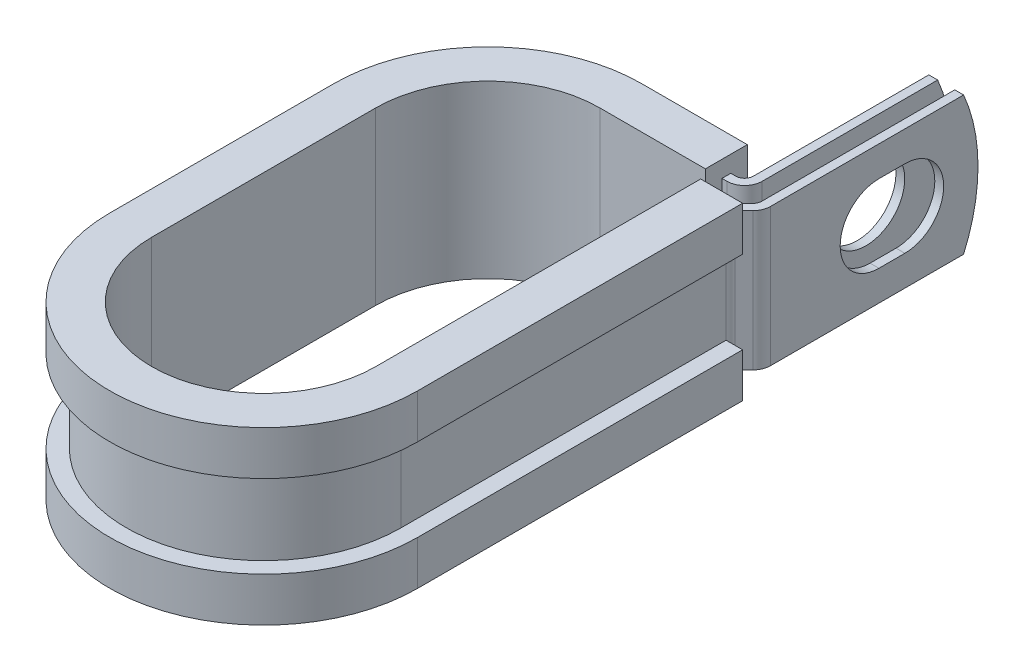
ISO-10303-21;
HEADER;
FILE_DESCRIPTION(('STEP AP214'),'2;1');
FILE_NAME('part.step','',(''),(''),'','','');
FILE_SCHEMA(('AUTOMOTIVE_DESIGN { 1 0 10303 214 1 1 1 1 }'));
ENDSEC;
DATA;
#1=APPLICATION_CONTEXT('core data for automotive mechanical design processes');
#2=APPLICATION_PROTOCOL_DEFINITION('international standard','automotive_design',2000,#1);
#3=PRODUCT_CONTEXT('',#1,'mechanical');
#4=PRODUCT('Part','Part','',(#3));
#5=PRODUCT_RELATED_PRODUCT_CATEGORY('part','',(#4));
#6=PRODUCT_DEFINITION_FORMATION('','',#4);
#7=PRODUCT_DEFINITION_CONTEXT('part definition',#1,'design');
#8=PRODUCT_DEFINITION('design','',#6,#7);
#9=PRODUCT_DEFINITION_SHAPE('','',#8);
#10=(LENGTH_UNIT() NAMED_UNIT(*) SI_UNIT(.MILLI.,.METRE.));
#11=(NAMED_UNIT(*) PLANE_ANGLE_UNIT() SI_UNIT($,.RADIAN.));
#12=(NAMED_UNIT(*) SI_UNIT($,.STERADIAN.) SOLID_ANGLE_UNIT());
#13=UNCERTAINTY_MEASURE_WITH_UNIT(LENGTH_MEASURE(1.E-05),#10,'distance_accuracy_value','');
#14=(GEOMETRIC_REPRESENTATION_CONTEXT(3) GLOBAL_UNCERTAINTY_ASSIGNED_CONTEXT((#13)) GLOBAL_UNIT_ASSIGNED_CONTEXT((#10,
#11,#12)) REPRESENTATION_CONTEXT('',''));
#15=CARTESIAN_POINT('',(0.,0.,0.));
#16=DIRECTION('',(0.,0.,1.));
#17=DIRECTION('',(1.,0.,0.));
#18=AXIS2_PLACEMENT_3D('',#15,#16,#17);
#19=CARTESIAN_POINT('',(12.5639743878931,-6.35,-11.8364));
#20=DIRECTION('',(0.,1.,0.));
#21=DIRECTION('',(1.,0.,0.));
#22=AXIS2_PLACEMENT_3D('',#19,#20,#21);
#23=PLANE('',#22);
#24=DIRECTION('',(0.,0.,-1.));
#25=VECTOR('',#24,1.);
#26=CARTESIAN_POINT('',(9.71917438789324,-6.35,-11.8364));
#27=LINE('',#26,#25);
#28=CARTESIAN_POINT('',(9.71917438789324,-6.35,-11.8364));
#29=VERTEX_POINT('',#28);
#30=CARTESIAN_POINT('',(9.71917438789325,-6.35,-12.6492));
#31=VERTEX_POINT('',#30);
#32=EDGE_CURVE('E582',#29,#31,#27,.T.);
#33=ORIENTED_EDGE('',*,*,#32,.T.);
#34=DIRECTION('',(1.,0.,0.));
#35=VECTOR('',#34,1.);
#36=CARTESIAN_POINT('',(0.,-6.35,-12.6492));
#37=LINE('',#36,#35);
#38=CARTESIAN_POINT('',(10.1763743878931,-6.35,-12.6492));
#39=VERTEX_POINT('',#38);
#40=EDGE_CURVE('E416',#39,#31,#37,.F.);
#41=ORIENTED_EDGE('',*,*,#40,.F.);
#42=CARTESIAN_POINT('',(10.1763743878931,-6.35,-13.462));
#43=DIRECTION('',(0.,1.,0.));
#44=DIRECTION('',(1.,0.,0.));
#45=AXIS2_PLACEMENT_3D('',#42,#43,#44);
#46=CIRCLE('',#45,0.812799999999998);
#47=CARTESIAN_POINT('',(10.9891743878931,-6.35,-13.462));
#48=VERTEX_POINT('',#47);
#49=EDGE_CURVE('E414',#48,#39,#46,.F.);
#50=ORIENTED_EDGE('',*,*,#49,.F.);
#51=DIRECTION('',(0.,0.,-1.));
#52=VECTOR('',#51,1.);
#53=CARTESIAN_POINT('',(10.9891743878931,-6.35,-30.9372));
#54=LINE('',#53,#52);
#55=CARTESIAN_POINT('',(10.9891743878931,-6.35,-29.6118778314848));
#56=VERTEX_POINT('',#55);
#57=EDGE_CURVE('E412',#56,#48,#54,.F.);
#58=ORIENTED_EDGE('',*,*,#57,.F.);
#59=DIRECTION('',(-1.,0.,0.));
#60=VECTOR('',#59,1.);
#61=CARTESIAN_POINT('',(14.1895743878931,-6.35,-29.6118778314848));
#62=LINE('',#61,#60);
#63=CARTESIAN_POINT('',(11.8019743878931,-6.35,-29.6118778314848));
#64=VERTEX_POINT('',#63);
#65=EDGE_CURVE('E12',#64,#56,#62,.T.);
#66=ORIENTED_EDGE('',*,*,#65,.F.);
#67=DIRECTION('',(0.,0.,1.));
#68=VECTOR('',#67,1.);
#69=CARTESIAN_POINT('',(11.8019743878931,-6.35,-30.9372));
#70=LINE('',#69,#68);
#71=CARTESIAN_POINT('',(11.8019743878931,-6.35,-13.462));
#72=VERTEX_POINT('',#71);
#73=EDGE_CURVE('E410',#64,#72,#70,.T.);
#74=ORIENTED_EDGE('',*,*,#73,.T.);
#75=CARTESIAN_POINT('',(10.1763743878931,-6.35,-13.462));
#76=DIRECTION('',(0.,-1.,0.));
#77=DIRECTION('',(0.,0.,1.));
#78=AXIS2_PLACEMENT_3D('',#75,#76,#77);
#79=CIRCLE('',#78,1.6256);
#80=CARTESIAN_POINT('',(10.1763743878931,-6.35,-11.8364));
#81=VERTEX_POINT('',#80);
#82=EDGE_CURVE('E407',#72,#81,#79,.T.);
#83=ORIENTED_EDGE('',*,*,#82,.T.);
#84=DIRECTION('',(-1.,0.,0.));
#85=VECTOR('',#84,1.);
#86=CARTESIAN_POINT('',(0.,-6.35,-11.8364));
#87=LINE('',#86,#85);
#88=EDGE_CURVE('E404',#81,#29,#87,.T.);
#89=ORIENTED_EDGE('',*,*,#88,.T.);
#90=EDGE_LOOP('',(#33,#41,#50,#58,#66,#74,#83,#89));
#91=FACE_BOUND('',#90,.T.);
#92=ADVANCED_FACE('F55',(#91),#23,.F.);
#93=CARTESIAN_POINT('',(12.5639743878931,6.35,-11.8364));
#94=DIRECTION('',(0.,1.,0.));
#95=DIRECTION('',(1.,0.,0.));
#96=AXIS2_PLACEMENT_3D('',#93,#94,#95);
#97=PLANE('',#96);
#98=DIRECTION('',(1.,0.,0.));
#99=VECTOR('',#98,1.);
#100=CARTESIAN_POINT('',(0.,6.35,-12.6492));
#101=LINE('',#100,#99);
#102=CARTESIAN_POINT('',(10.1763743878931,6.35,-12.6492));
#103=VERTEX_POINT('',#102);
#104=CARTESIAN_POINT('',(9.71917438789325,6.35,-12.6492));
#105=VERTEX_POINT('',#104);
#106=EDGE_CURVE('E377',#103,#105,#101,.F.);
#107=ORIENTED_EDGE('',*,*,#106,.T.);
#108=DIRECTION('',(0.,0.,1.));
#109=VECTOR('',#108,1.);
#110=CARTESIAN_POINT('',(9.71917438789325,6.35,-12.6492));
#111=LINE('',#110,#109);
#112=CARTESIAN_POINT('',(9.71917438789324,6.35,-11.8364));
#113=VERTEX_POINT('',#112);
#114=EDGE_CURVE('E588',#105,#113,#111,.T.);
#115=ORIENTED_EDGE('',*,*,#114,.T.);
#116=DIRECTION('',(-1.,0.,0.));
#117=VECTOR('',#116,1.);
#118=CARTESIAN_POINT('',(0.,6.35,-11.8364));
#119=LINE('',#118,#117);
#120=CARTESIAN_POINT('',(10.1763743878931,6.35,-11.8364));
#121=VERTEX_POINT('',#120);
#122=EDGE_CURVE('E479',#121,#113,#119,.T.);
#123=ORIENTED_EDGE('',*,*,#122,.F.);
#124=CARTESIAN_POINT('',(10.1763743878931,6.35,-13.462));
#125=DIRECTION('',(0.,-1.,0.));
#126=DIRECTION('',(0.,0.,1.));
#127=AXIS2_PLACEMENT_3D('',#124,#125,#126);
#128=CIRCLE('',#127,1.6256);
#129=CARTESIAN_POINT('',(11.8019743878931,6.35,-13.462));
#130=VERTEX_POINT('',#129);
#131=EDGE_CURVE('E474',#130,#121,#128,.T.);
#132=ORIENTED_EDGE('',*,*,#131,.F.);
#133=DIRECTION('',(0.,0.,1.));
#134=VECTOR('',#133,1.);
#135=CARTESIAN_POINT('',(11.8019743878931,6.35,-30.9372));
#136=LINE('',#135,#134);
#137=CARTESIAN_POINT('',(11.8019743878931,6.35,-29.6118778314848));
#138=VERTEX_POINT('',#137);
#139=EDGE_CURVE('E468',#138,#130,#136,.T.);
#140=ORIENTED_EDGE('',*,*,#139,.F.);
#141=DIRECTION('',(-1.,0.,0.));
#142=VECTOR('',#141,1.);
#143=CARTESIAN_POINT('',(14.1895743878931,6.35,-29.6118778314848));
#144=LINE('',#143,#142);
#145=CARTESIAN_POINT('',(10.9891743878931,6.35,-29.6118778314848));
#146=VERTEX_POINT('',#145);
#147=EDGE_CURVE('E63',#138,#146,#144,.T.);
#148=ORIENTED_EDGE('',*,*,#147,.T.);
#149=DIRECTION('',(0.,0.,-1.));
#150=VECTOR('',#149,1.);
#151=CARTESIAN_POINT('',(10.9891743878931,6.35,-30.9372));
#152=LINE('',#151,#150);
#153=CARTESIAN_POINT('',(10.9891743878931,6.35,-13.462));
#154=VERTEX_POINT('',#153);
#155=EDGE_CURVE('E465',#146,#154,#152,.F.);
#156=ORIENTED_EDGE('',*,*,#155,.T.);
#157=CARTESIAN_POINT('',(10.1763743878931,6.35,-13.462));
#158=DIRECTION('',(0.,1.,0.));
#159=DIRECTION('',(1.,0.,0.));
#160=AXIS2_PLACEMENT_3D('',#157,#158,#159);
#161=CIRCLE('',#160,0.812799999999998);
#162=EDGE_CURVE('E382',#154,#103,#161,.F.);
#163=ORIENTED_EDGE('',*,*,#162,.T.);
#164=EDGE_LOOP('',(#107,#115,#123,#132,#140,#148,#156,#163));
#165=FACE_BOUND('',#164,.T.);
#166=ADVANCED_FACE('F464',(#165),#97,.T.);
#167=CARTESIAN_POINT('',(0.,6.35,-11.8364));
#168=DIRECTION('',(0.,0.,1.));
#169=DIRECTION('',(1.,0.,0.));
#170=AXIS2_PLACEMENT_3D('',#167,#168,#169);
#171=PLANE('',#170);
#172=ORIENTED_EDGE('',*,*,#122,.T.);
#173=DIRECTION('',(0.,-1.,0.));
#174=VECTOR('',#173,1.);
#175=CARTESIAN_POINT('',(9.71917438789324,6.35,-11.8364));
#176=LINE('',#175,#174);
#177=EDGE_CURVE('E585',#113,#29,#176,.T.);
#178=ORIENTED_EDGE('',*,*,#177,.T.);
#179=ORIENTED_EDGE('',*,*,#88,.F.);
#180=DIRECTION('',(0.,-1.,0.));
#181=VECTOR('',#180,1.);
#182=CARTESIAN_POINT('',(10.1763743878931,6.35,-11.8364));
#183=LINE('',#182,#181);
#184=EDGE_CURVE('E452',#121,#81,#183,.T.);
#185=ORIENTED_EDGE('',*,*,#184,.F.);
#186=EDGE_LOOP('',(#172,#178,#179,#185));
#187=FACE_BOUND('',#186,.T.);
#188=ADVANCED_FACE('F789',(#187),#171,.T.);
#189=CARTESIAN_POINT('',(14.1895743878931,6.35,-11.8364));
#190=DIRECTION('',(-1.,0.,0.));
#191=DIRECTION('',(0.,0.,1.));
#192=AXIS2_PLACEMENT_3D('',#189,#190,#191);
#193=PLANE('',#192);
#194=CARTESIAN_POINT('',(14.1895743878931,0.,-24.2062));
#195=DIRECTION('',(1.,0.,0.));
#196=DIRECTION('',(0.,0.,-1.));
#197=AXIS2_PLACEMENT_3D('',#194,#195,#196);
#198=CIRCLE('',#197,3.5687);
#199=CARTESIAN_POINT('',(14.1895743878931,-3.5687,-24.2062));
#200=VERTEX_POINT('',#199);
#201=CARTESIAN_POINT('',(14.1895743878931,3.5687,-24.2062));
#202=VERTEX_POINT('',#201);
#203=EDGE_CURVE('E527',#200,#202,#198,.T.);
#204=ORIENTED_EDGE('',*,*,#203,.F.);
#205=DIRECTION('',(0.,0.,-1.));
#206=VECTOR('',#205,1.);
#207=CARTESIAN_POINT('',(14.1895743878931,-3.5687,-21.8186));
#208=LINE('',#207,#206);
#209=CARTESIAN_POINT('',(14.1895743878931,-3.5687,-21.8186));
#210=VERTEX_POINT('',#209);
#211=EDGE_CURVE('E524',#210,#200,#208,.T.);
#212=ORIENTED_EDGE('',*,*,#211,.F.);
#213=CARTESIAN_POINT('',(14.1895743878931,0.,-21.8186));
#214=DIRECTION('',(1.,0.,0.));
#215=DIRECTION('',(0.,0.,-1.));
#216=AXIS2_PLACEMENT_3D('',#213,#214,#215);
#217=CIRCLE('',#216,3.5687);
#218=CARTESIAN_POINT('',(14.1895743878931,3.5687,-21.8186));
#219=VERTEX_POINT('',#218);
#220=EDGE_CURVE('E521',#219,#210,#217,.T.);
#221=ORIENTED_EDGE('',*,*,#220,.F.);
#222=DIRECTION('',(0.,0.,1.));
#223=VECTOR('',#222,1.);
#224=CARTESIAN_POINT('',(14.1895743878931,3.5687,-21.8186));
#225=LINE('',#224,#223);
#226=EDGE_CURVE('E520',#202,#219,#225,.T.);
#227=ORIENTED_EDGE('',*,*,#226,.F.);
#228=EDGE_LOOP('',(#204,#212,#221,#227));
#229=FACE_BOUND('',#228,.T.);
#230=DIRECTION('',(0.,0.,-1.));
#231=VECTOR('',#230,1.);
#232=CARTESIAN_POINT('',(14.1895743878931,-6.35,-11.8364));
#233=LINE('',#232,#231);
#234=CARTESIAN_POINT('',(14.1895743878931,-6.35,-11.8364));
#235=VERTEX_POINT('',#234);
#236=CARTESIAN_POINT('',(14.1895743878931,-6.35,-29.6118778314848));
#237=VERTEX_POINT('',#236);
#238=EDGE_CURVE('E388',#235,#237,#233,.T.);
#239=ORIENTED_EDGE('',*,*,#238,.T.);
#240=CARTESIAN_POINT('',(14.1895743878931,0.,-15.0622));
#241=DIRECTION('',(-1.,0.,0.));
#242=DIRECTION('',(0.,0.,1.));
#243=AXIS2_PLACEMENT_3D('',#240,#241,#242);
#244=CIRCLE('',#243,15.875);
#245=CARTESIAN_POINT('',(14.1895743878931,6.35,-29.6118778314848));
#246=VERTEX_POINT('',#245);
#247=EDGE_CURVE('E536',#246,#237,#244,.T.);
#248=ORIENTED_EDGE('',*,*,#247,.F.);
#249=DIRECTION('',(0.,0.,-1.));
#250=VECTOR('',#249,1.);
#251=CARTESIAN_POINT('',(14.1895743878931,6.35,-11.8364));
#252=LINE('',#251,#250);
#253=CARTESIAN_POINT('',(14.1895743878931,6.35,-11.8364));
#254=VERTEX_POINT('',#253);
#255=EDGE_CURVE('E425',#254,#246,#252,.T.);
#256=ORIENTED_EDGE('',*,*,#255,.F.);
#257=DIRECTION('',(0.,-1.,0.));
#258=VECTOR('',#257,1.);
#259=CARTESIAN_POINT('',(14.1895743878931,6.35,-11.8364));
#260=LINE('',#259,#258);
#261=EDGE_CURVE('E387',#254,#235,#260,.T.);
#262=ORIENTED_EDGE('',*,*,#261,.T.);
#263=EDGE_LOOP('',(#239,#248,#256,#262));
#264=FACE_BOUND('',#263,.T.);
#265=ADVANCED_FACE('F57',(#229,#264),#193,.F.);
#266=CARTESIAN_POINT('',(13.3767743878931,6.35,-11.8364));
#267=DIRECTION('',(-1.,0.,0.));
#268=DIRECTION('',(0.,0.,1.));
#269=AXIS2_PLACEMENT_3D('',#266,#267,#268);
#270=PLANE('',#269);
#271=DIRECTION('',(0.,0.,-1.));
#272=VECTOR('',#271,1.);
#273=CARTESIAN_POINT('',(13.3767743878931,-3.5687,-21.8186));
#274=LINE('',#273,#272);
#275=CARTESIAN_POINT('',(13.3767743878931,-3.5687,-21.8186));
#276=VERTEX_POINT('',#275);
#277=CARTESIAN_POINT('',(13.3767743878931,-3.5687,-24.2062));
#278=VERTEX_POINT('',#277);
#279=EDGE_CURVE('E505',#276,#278,#274,.T.);
#280=ORIENTED_EDGE('',*,*,#279,.T.);
#281=CARTESIAN_POINT('',(13.3767743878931,0.,-24.2062));
#282=DIRECTION('',(-1.,0.,0.));
#283=DIRECTION('',(0.,0.,1.));
#284=AXIS2_PLACEMENT_3D('',#281,#282,#283);
#285=CIRCLE('',#284,3.5687);
#286=CARTESIAN_POINT('',(13.3767743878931,3.5687,-24.2062));
#287=VERTEX_POINT('',#286);
#288=EDGE_CURVE('E504',#278,#287,#285,.F.);
#289=ORIENTED_EDGE('',*,*,#288,.T.);
#290=DIRECTION('',(0.,0.,1.));
#291=VECTOR('',#290,1.);
#292=CARTESIAN_POINT('',(13.3767743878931,3.5687,-21.8186));
#293=LINE('',#292,#291);
#294=CARTESIAN_POINT('',(13.3767743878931,3.5687,-21.8186));
#295=VERTEX_POINT('',#294);
#296=EDGE_CURVE('E508',#287,#295,#293,.T.);
#297=ORIENTED_EDGE('',*,*,#296,.T.);
#298=CARTESIAN_POINT('',(13.3767743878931,0.,-21.8186));
#299=DIRECTION('',(-1.,0.,0.));
#300=DIRECTION('',(0.,0.,1.));
#301=AXIS2_PLACEMENT_3D('',#298,#299,#300);
#302=CIRCLE('',#301,3.5687);
#303=EDGE_CURVE('E501',#295,#276,#302,.F.);
#304=ORIENTED_EDGE('',*,*,#303,.T.);
#305=EDGE_LOOP('',(#280,#289,#297,#304));
#306=FACE_BOUND('',#305,.T.);
#307=CARTESIAN_POINT('',(13.3767743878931,0.,-15.0622));
#308=DIRECTION('',(-1.,0.,0.));
#309=DIRECTION('',(0.,0.,1.));
#310=AXIS2_PLACEMENT_3D('',#307,#308,#309);
#311=CIRCLE('',#310,15.875);
#312=CARTESIAN_POINT('',(13.3767743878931,6.35,-29.6118778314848));
#313=VERTEX_POINT('',#312);
#314=CARTESIAN_POINT('',(13.3767743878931,-6.35,-29.6118778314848));
#315=VERTEX_POINT('',#314);
#316=EDGE_CURVE('E77',#313,#315,#311,.T.);
#317=ORIENTED_EDGE('',*,*,#316,.T.);
#318=DIRECTION('',(0.,0.,-1.));
#319=VECTOR('',#318,1.);
#320=CARTESIAN_POINT('',(13.3767743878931,-6.35,-11.8364));
#321=LINE('',#320,#319);
#322=CARTESIAN_POINT('',(13.3767743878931,-6.35,-11.8364));
#323=VERTEX_POINT('',#322);
#324=EDGE_CURVE('E391',#323,#315,#321,.T.);
#325=ORIENTED_EDGE('',*,*,#324,.F.);
#326=DIRECTION('',(0.,-1.,0.));
#327=VECTOR('',#326,1.);
#328=CARTESIAN_POINT('',(13.3767743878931,6.35,-11.8364));
#329=LINE('',#328,#327);
#330=CARTESIAN_POINT('',(13.3767743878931,6.35,-11.8364));
#331=VERTEX_POINT('',#330);
#332=EDGE_CURVE('E460',#331,#323,#329,.T.);
#333=ORIENTED_EDGE('',*,*,#332,.F.);
#334=DIRECTION('',(0.,0.,-1.));
#335=VECTOR('',#334,1.);
#336=CARTESIAN_POINT('',(13.3767743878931,6.35,-11.8364));
#337=LINE('',#336,#335);
#338=EDGE_CURVE('E489',#331,#313,#337,.T.);
#339=ORIENTED_EDGE('',*,*,#338,.T.);
#340=EDGE_LOOP('',(#317,#325,#333,#339));
#341=FACE_BOUND('',#340,.T.);
#342=ADVANCED_FACE('F762',(#306,#341),#270,.T.);
#343=CARTESIAN_POINT('',(11.8019743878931,6.35,-30.9372));
#344=DIRECTION('',(1.,0.,0.));
#345=DIRECTION('',(0.,0.,-1.));
#346=AXIS2_PLACEMENT_3D('',#343,#344,#345);
#347=PLANE('',#346);
#348=CARTESIAN_POINT('',(11.8019743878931,0.,-23.0124));
#349=DIRECTION('',(1.,0.,0.));
#350=DIRECTION('',(0.,0.,-1.));
#351=AXIS2_PLACEMENT_3D('',#348,#349,#350);
#352=CIRCLE('',#351,3.5687);
#353=CARTESIAN_POINT('',(11.8019743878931,0.,-26.5811));
#354=VERTEX_POINT('',#353);
#355=EDGE_CURVE('E392',#354,#354,#352,.F.);
#356=ORIENTED_EDGE('',*,*,#355,.T.);
#357=EDGE_LOOP('',(#356));
#358=FACE_BOUND('',#357,.T.);
#359=ORIENTED_EDGE('',*,*,#73,.F.);
#360=CARTESIAN_POINT('',(11.8019743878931,0.,-15.0622));
#361=DIRECTION('',(1.,0.,0.));
#362=DIRECTION('',(0.,0.,-1.));
#363=AXIS2_PLACEMENT_3D('',#360,#361,#362);
#364=CIRCLE('',#363,15.875);
#365=EDGE_CURVE('E532',#64,#138,#364,.T.);
#366=ORIENTED_EDGE('',*,*,#365,.T.);
#367=ORIENTED_EDGE('',*,*,#139,.T.);
#368=DIRECTION('',(0.,-1.,0.));
#369=VECTOR('',#368,1.);
#370=CARTESIAN_POINT('',(11.8019743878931,6.35,-13.462));
#371=LINE('',#370,#369);
#372=EDGE_CURVE('E449',#130,#72,#371,.T.);
#373=ORIENTED_EDGE('',*,*,#372,.T.);
#374=EDGE_LOOP('',(#359,#366,#367,#373));
#375=FACE_BOUND('',#374,.T.);
#376=ADVANCED_FACE('F797',(#358,#375),#347,.T.);
#377=CARTESIAN_POINT('',(10.9891743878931,6.35,-30.9372));
#378=DIRECTION('',(1.,0.,0.));
#379=DIRECTION('',(0.,0.,-1.));
#380=AXIS2_PLACEMENT_3D('',#377,#378,#379);
#381=PLANE('',#380);
#382=CARTESIAN_POINT('',(10.9891743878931,0.,-23.0124));
#383=DIRECTION('',(-1.,0.,0.));
#384=DIRECTION('',(0.,0.,1.));
#385=AXIS2_PLACEMENT_3D('',#382,#383,#384);
#386=CIRCLE('',#385,3.5687);
#387=CARTESIAN_POINT('',(10.9891743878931,0.,-19.4437));
#388=VERTEX_POINT('',#387);
#389=EDGE_CURVE('E496',#388,#388,#386,.T.);
#390=ORIENTED_EDGE('',*,*,#389,.F.);
#391=EDGE_LOOP('',(#390));
#392=FACE_BOUND('',#391,.T.);
#393=CARTESIAN_POINT('',(10.9891743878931,0.,-15.0622));
#394=DIRECTION('',(-1.,0.,0.));
#395=DIRECTION('',(0.,0.,1.));
#396=AXIS2_PLACEMENT_3D('',#393,#394,#395);
#397=CIRCLE('',#396,15.875);
#398=EDGE_CURVE('E69',#146,#56,#397,.T.);
#399=ORIENTED_EDGE('',*,*,#398,.T.);
#400=ORIENTED_EDGE('',*,*,#57,.T.);
#401=DIRECTION('',(0.,-1.,0.));
#402=VECTOR('',#401,1.);
#403=CARTESIAN_POINT('',(10.9891743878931,6.35,-13.462));
#404=LINE('',#403,#402);
#405=EDGE_CURVE('E446',#154,#48,#404,.T.);
#406=ORIENTED_EDGE('',*,*,#405,.F.);
#407=ORIENTED_EDGE('',*,*,#155,.F.);
#408=EDGE_LOOP('',(#399,#400,#406,#407));
#409=FACE_BOUND('',#408,.T.);
#410=ADVANCED_FACE('F471',(#392,#409),#381,.F.);
#411=CARTESIAN_POINT('',(13.462,-6.35,-9.28600726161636));
#412=DIRECTION('',(0.,1.,0.));
#413=DIRECTION('',(1.,0.,0.));
#414=AXIS2_PLACEMENT_3D('',#411,#412,#413);
#415=CIRCLE('',#414,0.812799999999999);
#416=CARTESIAN_POINT('',(12.6492,-6.35,-9.28600726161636));
#417=VERTEX_POINT('',#416);
#418=CARTESIAN_POINT('',(12.8872636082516,-6.35,-9.86074365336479));
#419=VERTEX_POINT('',#418);
#420=EDGE_CURVE('E419',#417,#419,#415,.F.);
#421=ORIENTED_EDGE('',*,*,#420,.F.);
#422=DIRECTION('',(1.,0.,0.));
#423=VECTOR('',#422,1.);
#424=CARTESIAN_POINT('',(11.8364,-6.35,-9.28600726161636));
#425=LINE('',#424,#423);
#426=CARTESIAN_POINT('',(11.8364,-6.35,-9.28600726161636));
#427=VERTEX_POINT('',#426);
#428=EDGE_CURVE('E370',#427,#417,#425,.T.);
#429=ORIENTED_EDGE('',*,*,#428,.F.);
#430=CARTESIAN_POINT('',(13.462,-6.35,-9.28600726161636));
#431=DIRECTION('',(0.,-1.,0.));
#432=DIRECTION('',(0.,0.,1.));
#433=AXIS2_PLACEMENT_3D('',#430,#431,#432);
#434=CIRCLE('',#433,1.6256);
#435=CARTESIAN_POINT('',(12.3125272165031,-6.35,-10.4354800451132));
#436=VERTEX_POINT('',#435);
#437=EDGE_CURVE('E401',#427,#436,#434,.T.);
#438=ORIENTED_EDGE('',*,*,#437,.T.);
#439=DIRECTION('',(0.707106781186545,0.,-0.70710678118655));
#440=VECTOR('',#439,1.);
#441=CARTESIAN_POINT('',(12.3125272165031,-6.35,-10.4354800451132));
#442=LINE('',#441,#440);
#443=CARTESIAN_POINT('',(13.1387107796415,-6.35,-11.2616636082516));
#444=VERTEX_POINT('',#443);
#445=EDGE_CURVE('E398',#436,#444,#442,.T.);
#446=ORIENTED_EDGE('',*,*,#445,.T.);
#447=CARTESIAN_POINT('',(12.5639743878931,-6.35,-11.8364));
#448=DIRECTION('',(0.,1.,0.));
#449=DIRECTION('',(0.,0.,1.));
#450=AXIS2_PLACEMENT_3D('',#447,#448,#449);
#451=CIRCLE('',#450,0.8128);
#452=EDGE_CURVE('E395',#444,#323,#451,.T.);
#453=ORIENTED_EDGE('',*,*,#452,.T.);
#454=ORIENTED_EDGE('',*,*,#324,.T.);
#455=DIRECTION('',(-1.,0.,0.));
#456=VECTOR('',#455,1.);
#457=CARTESIAN_POINT('',(14.1895743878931,-6.35,-29.6118778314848));
#458=LINE('',#457,#456);
#459=EDGE_CURVE('E538',#237,#315,#458,.T.);
#460=ORIENTED_EDGE('',*,*,#459,.F.);
#461=ORIENTED_EDGE('',*,*,#238,.F.);
#462=CARTESIAN_POINT('',(12.5639743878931,-6.35,-11.8364));
#463=DIRECTION('',(0.,1.,0.));
#464=DIRECTION('',(1.,0.,0.));
#465=AXIS2_PLACEMENT_3D('',#462,#463,#464);
#466=CIRCLE('',#465,1.6256);
#467=CARTESIAN_POINT('',(13.7134471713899,-6.35,-10.6869272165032));
#468=VERTEX_POINT('',#467);
#469=EDGE_CURVE('E423',#468,#235,#466,.T.);
#470=ORIENTED_EDGE('',*,*,#469,.F.);
#471=DIRECTION('',(0.707106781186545,0.,-0.70710678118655));
#472=VECTOR('',#471,1.);
#473=CARTESIAN_POINT('',(12.8872636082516,-6.35,-9.86074365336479));
#474=LINE('',#473,#472);
#475=EDGE_CURVE('E421',#419,#468,#474,.T.);
#476=ORIENTED_EDGE('',*,*,#475,.F.);
#477=EDGE_LOOP('',(#421,#429,#438,#446,#453,#454,#460,#461,#470,#476));
#478=FACE_BOUND('',#477,.T.);
#479=ADVANCED_FACE('F743',(#478),#23,.F.);
#480=DIRECTION('',(-1.,0.,0.));
#481=VECTOR('',#480,1.);
#482=CARTESIAN_POINT('',(12.6492,6.35,-9.28600726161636));
#483=LINE('',#482,#481);
#484=CARTESIAN_POINT('',(12.6492,6.35,-9.28600726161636));
#485=VERTEX_POINT('',#484);
#486=CARTESIAN_POINT('',(11.8364,6.35,-9.28600726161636));
#487=VERTEX_POINT('',#486);
#488=EDGE_CURVE('E350',#485,#487,#483,.T.);
#489=ORIENTED_EDGE('',*,*,#488,.F.);
#490=CARTESIAN_POINT('',(13.462,6.35,-9.28600726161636));
#491=DIRECTION('',(0.,1.,0.));
#492=DIRECTION('',(1.,0.,0.));
#493=AXIS2_PLACEMENT_3D('',#490,#491,#492);
#494=CIRCLE('',#493,0.812799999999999);
#495=CARTESIAN_POINT('',(12.8872636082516,6.35,-9.86074365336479));
#496=VERTEX_POINT('',#495);
#497=EDGE_CURVE('E365',#485,#496,#494,.F.);
#498=ORIENTED_EDGE('',*,*,#497,.T.);
#499=DIRECTION('',(0.707106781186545,0.,-0.70710678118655));
#500=VECTOR('',#499,1.);
#501=CARTESIAN_POINT('',(12.8872636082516,6.35,-9.86074365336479));
#502=LINE('',#501,#500);
#503=CARTESIAN_POINT('',(13.7134471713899,6.35,-10.6869272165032));
#504=VERTEX_POINT('',#503);
#505=EDGE_CURVE('E376',#496,#504,#502,.T.);
#506=ORIENTED_EDGE('',*,*,#505,.T.);
#507=CARTESIAN_POINT('',(12.5639743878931,6.35,-11.8364));
#508=DIRECTION('',(0.,1.,0.));
#509=DIRECTION('',(1.,0.,0.));
#510=AXIS2_PLACEMENT_3D('',#507,#508,#509);
#511=CIRCLE('',#510,1.6256);
#512=EDGE_CURVE('E379',#504,#254,#511,.T.);
#513=ORIENTED_EDGE('',*,*,#512,.T.);
#514=ORIENTED_EDGE('',*,*,#255,.T.);
#515=DIRECTION('',(-1.,0.,0.));
#516=VECTOR('',#515,1.);
#517=CARTESIAN_POINT('',(14.1895743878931,6.35,-29.6118778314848));
#518=LINE('',#517,#516);
#519=EDGE_CURVE('E534',#246,#313,#518,.T.);
#520=ORIENTED_EDGE('',*,*,#519,.T.);
#521=ORIENTED_EDGE('',*,*,#338,.F.);
#522=CARTESIAN_POINT('',(12.5639743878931,6.35,-11.8364));
#523=DIRECTION('',(0.,1.,0.));
#524=DIRECTION('',(0.,0.,1.));
#525=AXIS2_PLACEMENT_3D('',#522,#523,#524);
#526=CIRCLE('',#525,0.8128);
#527=CARTESIAN_POINT('',(13.1387107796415,6.35,-11.2616636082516));
#528=VERTEX_POINT('',#527);
#529=EDGE_CURVE('E486',#528,#331,#526,.T.);
#530=ORIENTED_EDGE('',*,*,#529,.F.);
#531=DIRECTION('',(0.707106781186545,0.,-0.70710678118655));
#532=VECTOR('',#531,1.);
#533=CARTESIAN_POINT('',(12.3125272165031,6.35,-10.4354800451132));
#534=LINE('',#533,#532);
#535=CARTESIAN_POINT('',(12.3125272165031,6.35,-10.4354800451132));
#536=VERTEX_POINT('',#535);
#537=EDGE_CURVE('E483',#536,#528,#534,.T.);
#538=ORIENTED_EDGE('',*,*,#537,.F.);
#539=CARTESIAN_POINT('',(13.462,6.35,-9.28600726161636));
#540=DIRECTION('',(0.,-1.,0.));
#541=DIRECTION('',(0.,0.,1.));
#542=AXIS2_PLACEMENT_3D('',#539,#540,#541);
#543=CIRCLE('',#542,1.6256);
#544=EDGE_CURVE('E369',#487,#536,#543,.T.);
#545=ORIENTED_EDGE('',*,*,#544,.F.);
#546=EDGE_LOOP('',(#489,#498,#506,#513,#514,#520,#521,#530,#538,#545));
#547=FACE_BOUND('',#546,.T.);
#548=ADVANCED_FACE('F364',(#547),#97,.T.);
#549=CARTESIAN_POINT('',(12.5639743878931,6.35,-11.8364));
#550=DIRECTION('',(0.,-1.,0.));
#551=DIRECTION('',(0.,0.,-1.));
#552=AXIS2_PLACEMENT_3D('',#549,#550,#551);
#553=CYLINDRICAL_SURFACE('',#552,0.8128);
#554=ORIENTED_EDGE('',*,*,#452,.F.);
#555=DIRECTION('',(0.,-1.,0.));
#556=VECTOR('',#555,1.);
#557=CARTESIAN_POINT('',(13.1387107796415,6.35,-11.2616636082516));
#558=LINE('',#557,#556);
#559=EDGE_CURVE('E458',#528,#444,#558,.T.);
#560=ORIENTED_EDGE('',*,*,#559,.F.);
#561=ORIENTED_EDGE('',*,*,#529,.T.);
#562=ORIENTED_EDGE('',*,*,#332,.T.);
#563=EDGE_LOOP('',(#554,#560,#561,#562));
#564=FACE_BOUND('',#563,.T.);
#565=ADVANCED_FACE('F765',(#564),#553,.F.);
#566=CARTESIAN_POINT('',(12.3125272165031,6.35,-10.4354800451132));
#567=DIRECTION('',(-0.70710678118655,0.,-0.707106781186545));
#568=DIRECTION('',(-0.707106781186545,0.,0.70710678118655));
#569=AXIS2_PLACEMENT_3D('',#566,#567,#568);
#570=PLANE('',#569);
#571=ORIENTED_EDGE('',*,*,#445,.F.);
#572=DIRECTION('',(0.,-1.,0.));
#573=VECTOR('',#572,1.);
#574=CARTESIAN_POINT('',(12.3125272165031,6.35,-10.4354800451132));
#575=LINE('',#574,#573);
#576=EDGE_CURVE('E456',#536,#436,#575,.T.);
#577=ORIENTED_EDGE('',*,*,#576,.F.);
#578=ORIENTED_EDGE('',*,*,#537,.T.);
#579=ORIENTED_EDGE('',*,*,#559,.T.);
#580=EDGE_LOOP('',(#571,#577,#578,#579));
#581=FACE_BOUND('',#580,.T.);
#582=ADVANCED_FACE('F768',(#581),#570,.T.);
#583=CARTESIAN_POINT('',(13.462,6.35,-9.28600726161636));
#584=DIRECTION('',(0.,-1.,0.));
#585=DIRECTION('',(0.,0.,-1.));
#586=AXIS2_PLACEMENT_3D('',#583,#584,#585);
#587=CYLINDRICAL_SURFACE('',#586,1.6256);
#588=ORIENTED_EDGE('',*,*,#437,.F.);
#589=DIRECTION('',(0.,-1.,0.));
#590=VECTOR('',#589,1.);
#591=CARTESIAN_POINT('',(11.8364,6.35,-9.28600726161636));
#592=LINE('',#591,#590);
#593=EDGE_CURVE('E454',#487,#427,#592,.T.);
#594=ORIENTED_EDGE('',*,*,#593,.F.);
#595=ORIENTED_EDGE('',*,*,#544,.T.);
#596=ORIENTED_EDGE('',*,*,#576,.T.);
#597=EDGE_LOOP('',(#588,#594,#595,#596));
#598=FACE_BOUND('',#597,.T.);
#599=ADVANCED_FACE('F770',(#598),#587,.T.);
#600=CARTESIAN_POINT('',(10.1763743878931,6.35,-13.462));
#601=DIRECTION('',(0.,-1.,0.));
#602=DIRECTION('',(0.,0.,-1.));
#603=AXIS2_PLACEMENT_3D('',#600,#601,#602);
#604=CYLINDRICAL_SURFACE('',#603,1.6256);
#605=ORIENTED_EDGE('',*,*,#82,.F.);
#606=ORIENTED_EDGE('',*,*,#372,.F.);
#607=ORIENTED_EDGE('',*,*,#131,.T.);
#608=ORIENTED_EDGE('',*,*,#184,.T.);
#609=EDGE_LOOP('',(#605,#606,#607,#608));
#610=FACE_BOUND('',#609,.T.);
#611=ADVANCED_FACE('F772',(#610),#604,.T.);
#612=CARTESIAN_POINT('',(10.1763743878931,6.35,-13.462));
#613=DIRECTION('',(0.,-1.,0.));
#614=DIRECTION('',(0.,0.,-1.));
#615=AXIS2_PLACEMENT_3D('',#612,#613,#614);
#616=CYLINDRICAL_SURFACE('',#615,0.812799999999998);
#617=ORIENTED_EDGE('',*,*,#49,.T.);
#618=DIRECTION('',(0.,-1.,0.));
#619=VECTOR('',#618,1.);
#620=CARTESIAN_POINT('',(10.1763743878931,6.35,-12.6492));
#621=LINE('',#620,#619);
#622=EDGE_CURVE('E443',#103,#39,#621,.T.);
#623=ORIENTED_EDGE('',*,*,#622,.F.);
#624=ORIENTED_EDGE('',*,*,#162,.F.);
#625=ORIENTED_EDGE('',*,*,#405,.T.);
#626=EDGE_LOOP('',(#617,#623,#624,#625));
#627=FACE_BOUND('',#626,.T.);
#628=ADVANCED_FACE('F778',(#627),#616,.F.);
#629=CARTESIAN_POINT('',(0.,6.35,-12.6492));
#630=DIRECTION('',(0.,0.,1.));
#631=DIRECTION('',(1.,0.,0.));
#632=AXIS2_PLACEMENT_3D('',#629,#630,#631);
#633=PLANE('',#632);
#634=DIRECTION('',(0.,-1.,0.));
#635=VECTOR('',#634,1.);
#636=CARTESIAN_POINT('',(0.,6.35,-12.6492));
#637=LINE('',#636,#635);
#638=CARTESIAN_POINT('',(1.7550649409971E-13,3.81,-12.6492));
#639=VERTEX_POINT('',#638);
#640=CARTESIAN_POINT('',(1.7550649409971E-13,-3.81,-12.6492));
#641=VERTEX_POINT('',#640);
#642=EDGE_CURVE('E440',#639,#641,#637,.T.);
#643=ORIENTED_EDGE('',*,*,#642,.F.);
#644=DIRECTION('',(1.,0.,0.));
#645=VECTOR('',#644,1.);
#646=CARTESIAN_POINT('',(1.7550649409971E-13,3.81,-12.6492));
#647=LINE('',#646,#645);
#648=CARTESIAN_POINT('',(9.71917438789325,3.81,-12.6492));
#649=VERTEX_POINT('',#648);
#650=EDGE_CURVE('E541',#639,#649,#647,.T.);
#651=ORIENTED_EDGE('',*,*,#650,.T.);
#652=DIRECTION('',(0.,1.,0.));
#653=VECTOR('',#652,1.);
#654=CARTESIAN_POINT('',(9.71917438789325,6.35,-12.6492));
#655=LINE('',#654,#653);
#656=EDGE_CURVE('E591',#649,#105,#655,.T.);
#657=ORIENTED_EDGE('',*,*,#656,.T.);
#658=ORIENTED_EDGE('',*,*,#106,.F.);
#659=ORIENTED_EDGE('',*,*,#622,.T.);
#660=ORIENTED_EDGE('',*,*,#40,.T.);
#661=DIRECTION('',(0.,1.,0.));
#662=VECTOR('',#661,1.);
#663=CARTESIAN_POINT('',(9.71917438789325,-6.35,-12.6492));
#664=LINE('',#663,#662);
#665=CARTESIAN_POINT('',(9.71917438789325,-3.81,-12.6492));
#666=VERTEX_POINT('',#665);
#667=EDGE_CURVE('E579',#31,#666,#664,.T.);
#668=ORIENTED_EDGE('',*,*,#667,.T.);
#669=DIRECTION('',(1.,0.,0.));
#670=VECTOR('',#669,1.);
#671=CARTESIAN_POINT('',(1.7550649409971E-13,-3.81,-12.6492));
#672=LINE('',#671,#670);
#673=EDGE_CURVE('E562',#641,#666,#672,.T.);
#674=ORIENTED_EDGE('',*,*,#673,.F.);
#675=EDGE_LOOP('',(#643,#651,#657,#658,#659,#660,#668,#674));
#676=FACE_BOUND('',#675,.T.);
#677=ADVANCED_FACE('F830',(#676),#633,.F.);
#678=CARTESIAN_POINT('',(0.,6.35,0.));
#679=DIRECTION('',(0.,-1.,0.));
#680=DIRECTION('',(0.,0.,-1.));
#681=AXIS2_PLACEMENT_3D('',#678,#679,#680);
#682=CYLINDRICAL_SURFACE('',#681,12.6492);
#683=DIRECTION('',(0.,-1.,0.));
#684=VECTOR('',#683,1.);
#685=CARTESIAN_POINT('',(-12.6492,6.35,0.));
#686=LINE('',#685,#684);
#687=CARTESIAN_POINT('',(-12.6492,3.81,-1.73472347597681E-13));
#688=VERTEX_POINT('',#687);
#689=CARTESIAN_POINT('',(-12.6492,-3.81,-1.73472347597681E-13));
#690=VERTEX_POINT('',#689);
#691=EDGE_CURVE('E437',#688,#690,#686,.T.);
#692=ORIENTED_EDGE('',*,*,#691,.F.);
#693=CARTESIAN_POINT('',(0.,3.81,0.));
#694=DIRECTION('',(0.,-1.,0.));
#695=DIRECTION('',(0.,0.,-1.));
#696=AXIS2_PLACEMENT_3D('',#693,#694,#695);
#697=CIRCLE('',#696,12.6492);
#698=EDGE_CURVE('E594',#688,#639,#697,.T.);
#699=ORIENTED_EDGE('',*,*,#698,.T.);
#700=ORIENTED_EDGE('',*,*,#642,.T.);
#701=CARTESIAN_POINT('',(0.,-3.81,0.));
#702=DIRECTION('',(0.,-1.,0.));
#703=DIRECTION('',(0.,0.,-1.));
#704=AXIS2_PLACEMENT_3D('',#701,#702,#703);
#705=CIRCLE('',#704,12.6492);
#706=EDGE_CURVE('E615',#690,#641,#705,.T.);
#707=ORIENTED_EDGE('',*,*,#706,.F.);
#708=EDGE_LOOP('',(#692,#699,#700,#707));
#709=FACE_BOUND('',#708,.T.);
#710=ADVANCED_FACE('F841',(#709),#682,.T.);
#711=CARTESIAN_POINT('',(-12.6492,6.35,0.));
#712=DIRECTION('',(1.,0.,0.));
#713=DIRECTION('',(0.,0.,-1.));
#714=AXIS2_PLACEMENT_3D('',#711,#712,#713);
#715=PLANE('',#714);
#716=DIRECTION('',(0.,-1.,0.));
#717=VECTOR('',#716,1.);
#718=CARTESIAN_POINT('',(-12.6492,6.35,20.6248));
#719=LINE('',#718,#717);
#720=CARTESIAN_POINT('',(-12.6492,3.81,20.6247999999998));
#721=VERTEX_POINT('',#720);
#722=CARTESIAN_POINT('',(-12.6492,-3.81,20.6247999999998));
#723=VERTEX_POINT('',#722);
#724=EDGE_CURVE('E434',#721,#723,#719,.T.);
#725=ORIENTED_EDGE('',*,*,#724,.F.);
#726=DIRECTION('',(0.,0.,-1.));
#727=VECTOR('',#726,1.);
#728=CARTESIAN_POINT('',(-12.6492,3.81,20.6247999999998));
#729=LINE('',#728,#727);
#730=EDGE_CURVE('E626',#721,#688,#729,.T.);
#731=ORIENTED_EDGE('',*,*,#730,.T.);
#732=ORIENTED_EDGE('',*,*,#691,.T.);
#733=DIRECTION('',(0.,0.,-1.));
#734=VECTOR('',#733,1.);
#735=CARTESIAN_POINT('',(-12.6492,-3.81,20.6247999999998));
#736=LINE('',#735,#734);
#737=EDGE_CURVE('E647',#723,#690,#736,.T.);
#738=ORIENTED_EDGE('',*,*,#737,.F.);
#739=EDGE_LOOP('',(#725,#731,#732,#738));
#740=FACE_BOUND('',#739,.T.);
#741=ADVANCED_FACE('F846',(#740),#715,.F.);
#742=CARTESIAN_POINT('',(0.,6.35,20.6248));
#743=DIRECTION('',(0.,-1.,0.));
#744=DIRECTION('',(0.,0.,-1.));
#745=AXIS2_PLACEMENT_3D('',#742,#743,#744);
#746=CYLINDRICAL_SURFACE('',#745,12.6492);
#747=DIRECTION('',(0.,-1.,0.));
#748=VECTOR('',#747,1.);
#749=CARTESIAN_POINT('',(12.6492,6.35,20.6248));
#750=LINE('',#749,#748);
#751=CARTESIAN_POINT('',(12.6492,3.81,20.6248));
#752=VERTEX_POINT('',#751);
#753=CARTESIAN_POINT('',(12.6492,-3.81,20.6248));
#754=VERTEX_POINT('',#753);
#755=EDGE_CURVE('E359',#752,#754,#750,.T.);
#756=ORIENTED_EDGE('',*,*,#755,.F.);
#757=CARTESIAN_POINT('',(0.,3.81,20.6248));
#758=DIRECTION('',(0.,-1.,0.));
#759=DIRECTION('',(0.,0.,-1.));
#760=AXIS2_PLACEMENT_3D('',#757,#758,#759);
#761=CIRCLE('',#760,12.6492);
#762=EDGE_CURVE('E658',#752,#721,#761,.T.);
#763=ORIENTED_EDGE('',*,*,#762,.T.);
#764=ORIENTED_EDGE('',*,*,#724,.T.);
#765=CARTESIAN_POINT('',(0.,-3.81,20.6248));
#766=DIRECTION('',(0.,-1.,0.));
#767=DIRECTION('',(0.,0.,-1.));
#768=AXIS2_PLACEMENT_3D('',#765,#766,#767);
#769=CIRCLE('',#768,12.6492);
#770=EDGE_CURVE('E679',#754,#723,#769,.T.);
#771=ORIENTED_EDGE('',*,*,#770,.F.);
#772=EDGE_LOOP('',(#756,#763,#764,#771));
#773=FACE_BOUND('',#772,.T.);
#774=ADVANCED_FACE('F851',(#773),#746,.T.);
#775=CARTESIAN_POINT('',(12.6492,6.35,0.));
#776=DIRECTION('',(-1.,0.,0.));
#777=DIRECTION('',(0.,0.,1.));
#778=AXIS2_PLACEMENT_3D('',#775,#776,#777);
#779=PLANE('',#778);
#780=DIRECTION('',(0.,-1.,0.));
#781=VECTOR('',#780,1.);
#782=CARTESIAN_POINT('',(12.6492,6.35,-9.28600726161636));
#783=LINE('',#782,#781);
#784=CARTESIAN_POINT('',(12.6492,3.81,-9.28600726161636));
#785=VERTEX_POINT('',#784);
#786=CARTESIAN_POINT('',(12.6492,-3.81,-9.28600726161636));
#787=VERTEX_POINT('',#786);
#788=EDGE_CURVE('E360',#785,#787,#783,.T.);
#789=ORIENTED_EDGE('',*,*,#788,.F.);
#790=DIRECTION('',(0.,0.,-1.));
#791=VECTOR('',#790,1.);
#792=CARTESIAN_POINT('',(12.6492,3.81,0.));
#793=LINE('',#792,#791);
#794=EDGE_CURVE('E699',#752,#785,#793,.T.);
#795=ORIENTED_EDGE('',*,*,#794,.F.);
#796=ORIENTED_EDGE('',*,*,#755,.T.);
#797=DIRECTION('',(0.,0.,-1.));
#798=VECTOR('',#797,1.);
#799=CARTESIAN_POINT('',(12.6492,-3.81,0.));
#800=LINE('',#799,#798);
#801=EDGE_CURVE('E700',#754,#787,#800,.T.);
#802=ORIENTED_EDGE('',*,*,#801,.T.);
#803=EDGE_LOOP('',(#789,#795,#796,#802));
#804=FACE_BOUND('',#803,.T.);
#805=ADVANCED_FACE('F854',(#804),#779,.F.);
#806=CARTESIAN_POINT('',(13.462,6.35,-9.28600726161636));
#807=DIRECTION('',(0.,-1.,0.));
#808=DIRECTION('',(0.,0.,-1.));
#809=AXIS2_PLACEMENT_3D('',#806,#807,#808);
#810=CYLINDRICAL_SURFACE('',#809,0.812799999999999);
#811=ORIENTED_EDGE('',*,*,#420,.T.);
#812=DIRECTION('',(0.,-1.,0.));
#813=VECTOR('',#812,1.);
#814=CARTESIAN_POINT('',(12.8872636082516,6.35,-9.86074365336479));
#815=LINE('',#814,#813);
#816=EDGE_CURVE('E374',#496,#419,#815,.T.);
#817=ORIENTED_EDGE('',*,*,#816,.F.);
#818=ORIENTED_EDGE('',*,*,#497,.F.);
#819=EDGE_CURVE('E347',#485,#785,#783,.T.);
#820=ORIENTED_EDGE('',*,*,#819,.T.);
#821=ORIENTED_EDGE('',*,*,#788,.T.);
#822=DIRECTION('',(0.,1.,0.));
#823=VECTOR('',#822,1.);
#824=CARTESIAN_POINT('',(12.6492,-6.35,-9.28600726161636));
#825=LINE('',#824,#823);
#826=EDGE_CURVE('E734',#417,#787,#825,.T.);
#827=ORIENTED_EDGE('',*,*,#826,.F.);
#828=EDGE_LOOP('',(#811,#817,#818,#820,#821,#827));
#829=FACE_BOUND('',#828,.T.);
#830=ADVANCED_FACE('F372',(#829),#810,.F.);
#831=CARTESIAN_POINT('',(12.8872636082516,6.35,-9.86074365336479));
#832=DIRECTION('',(-0.70710678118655,0.,-0.707106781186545));
#833=DIRECTION('',(-0.707106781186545,0.,0.70710678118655));
#834=AXIS2_PLACEMENT_3D('',#831,#832,#833);
#835=PLANE('',#834);
#836=ORIENTED_EDGE('',*,*,#475,.T.);
#837=DIRECTION('',(0.,-1.,0.));
#838=VECTOR('',#837,1.);
#839=CARTESIAN_POINT('',(13.7134471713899,6.35,-10.6869272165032));
#840=LINE('',#839,#838);
#841=EDGE_CURVE('E428',#504,#468,#840,.T.);
#842=ORIENTED_EDGE('',*,*,#841,.F.);
#843=ORIENTED_EDGE('',*,*,#505,.F.);
#844=ORIENTED_EDGE('',*,*,#816,.T.);
#845=EDGE_LOOP('',(#836,#842,#843,#844));
#846=FACE_BOUND('',#845,.T.);
#847=ADVANCED_FACE('F748',(#846),#835,.F.);
#848=CARTESIAN_POINT('',(12.5639743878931,6.35,-11.8364));
#849=DIRECTION('',(0.,-1.,0.));
#850=DIRECTION('',(0.,0.,-1.));
#851=AXIS2_PLACEMENT_3D('',#848,#849,#850);
#852=CYLINDRICAL_SURFACE('',#851,1.6256);
#853=ORIENTED_EDGE('',*,*,#469,.T.);
#854=ORIENTED_EDGE('',*,*,#261,.F.);
#855=ORIENTED_EDGE('',*,*,#512,.F.);
#856=ORIENTED_EDGE('',*,*,#841,.T.);
#857=EDGE_LOOP('',(#853,#854,#855,#856));
#858=FACE_BOUND('',#857,.T.);
#859=ADVANCED_FACE('F751',(#858),#852,.T.);
#860=CARTESIAN_POINT('',(21.8957822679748,0.,-23.0124));
#861=DIRECTION('',(-1.,0.,0.));
#862=DIRECTION('',(0.,0.,1.));
#863=AXIS2_PLACEMENT_3D('',#860,#861,#862);
#864=CYLINDRICAL_SURFACE('',#863,3.5687);
#865=ORIENTED_EDGE('',*,*,#389,.T.);
#866=EDGE_LOOP('',(#865));
#867=FACE_BOUND('',#866,.T.);
#868=ORIENTED_EDGE('',*,*,#355,.F.);
#869=EDGE_LOOP('',(#868));
#870=FACE_BOUND('',#869,.T.);
#871=ADVANCED_FACE('F965',(#867,#870),#864,.F.);
#872=CARTESIAN_POINT('',(1.47433330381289,-3.5687,-21.8186));
#873=DIRECTION('',(0.,-1.,0.));
#874=DIRECTION('',(0.,0.,-1.));
#875=AXIS2_PLACEMENT_3D('',#872,#873,#874);
#876=PLANE('',#875);
#877=DIRECTION('',(1.,0.,0.));
#878=VECTOR('',#877,1.);
#879=CARTESIAN_POINT('',(1.47433330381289,-3.5687,-21.8186));
#880=LINE('',#879,#878);
#881=EDGE_CURVE('E499',#276,#210,#880,.T.);
#882=ORIENTED_EDGE('',*,*,#881,.T.);
#883=ORIENTED_EDGE('',*,*,#211,.T.);
#884=DIRECTION('',(1.,0.,0.));
#885=VECTOR('',#884,1.);
#886=CARTESIAN_POINT('',(1.47433330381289,-3.5687,-24.2062));
#887=LINE('',#886,#885);
#888=EDGE_CURVE('E502',#278,#200,#887,.T.);
#889=ORIENTED_EDGE('',*,*,#888,.F.);
#890=ORIENTED_EDGE('',*,*,#279,.F.);
#891=EDGE_LOOP('',(#882,#883,#889,#890));
#892=FACE_BOUND('',#891,.T.);
#893=ADVANCED_FACE('F961',(#892),#876,.F.);
#894=CARTESIAN_POINT('',(1.47433330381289,0.,-24.2062));
#895=DIRECTION('',(1.,0.,0.));
#896=DIRECTION('',(0.,0.,-1.));
#897=AXIS2_PLACEMENT_3D('',#894,#895,#896);
#898=CYLINDRICAL_SURFACE('',#897,3.5687);
#899=ORIENTED_EDGE('',*,*,#888,.T.);
#900=ORIENTED_EDGE('',*,*,#203,.T.);
#901=DIRECTION('',(1.,0.,0.));
#902=VECTOR('',#901,1.);
#903=CARTESIAN_POINT('',(1.47433330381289,3.5687,-24.2062));
#904=LINE('',#903,#902);
#905=EDGE_CURVE('E506',#287,#202,#904,.T.);
#906=ORIENTED_EDGE('',*,*,#905,.F.);
#907=ORIENTED_EDGE('',*,*,#288,.F.);
#908=EDGE_LOOP('',(#899,#900,#906,#907));
#909=FACE_BOUND('',#908,.T.);
#910=ADVANCED_FACE('F957',(#909),#898,.F.);
#911=CARTESIAN_POINT('',(1.47433330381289,3.5687,-21.8186));
#912=DIRECTION('',(0.,1.,0.));
#913=DIRECTION('',(0.,0.,1.));
#914=AXIS2_PLACEMENT_3D('',#911,#912,#913);
#915=PLANE('',#914);
#916=ORIENTED_EDGE('',*,*,#905,.T.);
#917=ORIENTED_EDGE('',*,*,#226,.T.);
#918=DIRECTION('',(1.,0.,0.));
#919=VECTOR('',#918,1.);
#920=CARTESIAN_POINT('',(1.47433330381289,3.5687,-21.8186));
#921=LINE('',#920,#919);
#922=EDGE_CURVE('E509',#295,#219,#921,.T.);
#923=ORIENTED_EDGE('',*,*,#922,.F.);
#924=ORIENTED_EDGE('',*,*,#296,.F.);
#925=EDGE_LOOP('',(#916,#917,#923,#924));
#926=FACE_BOUND('',#925,.T.);
#927=ADVANCED_FACE('F953',(#926),#915,.F.);
#928=CARTESIAN_POINT('',(1.47433330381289,0.,-21.8186));
#929=DIRECTION('',(1.,0.,0.));
#930=DIRECTION('',(0.,0.,-1.));
#931=AXIS2_PLACEMENT_3D('',#928,#929,#930);
#932=CYLINDRICAL_SURFACE('',#931,3.5687);
#933=ORIENTED_EDGE('',*,*,#922,.T.);
#934=ORIENTED_EDGE('',*,*,#220,.T.);
#935=ORIENTED_EDGE('',*,*,#881,.F.);
#936=ORIENTED_EDGE('',*,*,#303,.F.);
#937=EDGE_LOOP('',(#933,#934,#935,#936));
#938=FACE_BOUND('',#937,.T.);
#939=ADVANCED_FACE('F950',(#938),#932,.F.);
#940=CARTESIAN_POINT('',(14.1895743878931,0.,-15.0622));
#941=DIRECTION('',(-1.,0.,0.));
#942=DIRECTION('',(0.,0.,1.));
#943=AXIS2_PLACEMENT_3D('',#940,#941,#942);
#944=CYLINDRICAL_SURFACE('',#943,15.875);
#945=ORIENTED_EDGE('',*,*,#365,.F.);
#946=ORIENTED_EDGE('',*,*,#65,.T.);
#947=ORIENTED_EDGE('',*,*,#398,.F.);
#948=ORIENTED_EDGE('',*,*,#147,.F.);
#949=EDGE_LOOP('',(#945,#946,#947,#948));
#950=FACE_BOUND('',#949,.T.);
#951=ADVANCED_FACE('F821',(#950),#944,.T.);
#952=ORIENTED_EDGE('',*,*,#519,.F.);
#953=ORIENTED_EDGE('',*,*,#247,.T.);
#954=ORIENTED_EDGE('',*,*,#459,.T.);
#955=ORIENTED_EDGE('',*,*,#316,.F.);
#956=EDGE_LOOP('',(#952,#953,#954,#955));
#957=FACE_BOUND('',#956,.T.);
#958=ADVANCED_FACE('F758',(#957),#944,.T.);
#959=CARTESIAN_POINT('',(2.00037700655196E-13,7.874,-14.1732));
#960=DIRECTION('',(0.,0.,1.));
#961=DIRECTION('',(1.,0.,0.));
#962=AXIS2_PLACEMENT_3D('',#959,#960,#961);
#963=PLANE('',#962);
#964=DIRECTION('',(0.,-1.,0.));
#965=VECTOR('',#964,1.);
#966=CARTESIAN_POINT('',(2.00037700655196E-13,7.874,-14.1732));
#967=LINE('',#966,#965);
#968=CARTESIAN_POINT('',(2.00037700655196E-13,7.874,-14.1732));
#969=VERTEX_POINT('',#968);
#970=CARTESIAN_POINT('',(2.00037700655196E-13,3.81,-14.1732));
#971=VERTEX_POINT('',#970);
#972=EDGE_CURVE('E617',#969,#971,#967,.T.);
#973=ORIENTED_EDGE('',*,*,#972,.F.);
#974=DIRECTION('',(1.,0.,0.));
#975=VECTOR('',#974,1.);
#976=CARTESIAN_POINT('',(2.00037700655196E-13,7.874,-14.1732));
#977=LINE('',#976,#975);
#978=CARTESIAN_POINT('',(9.71917438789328,7.874,-14.1732));
#979=VERTEX_POINT('',#978);
#980=EDGE_CURVE('E547',#969,#979,#977,.T.);
#981=ORIENTED_EDGE('',*,*,#980,.T.);
#982=DIRECTION('',(0.,-1.,0.));
#983=VECTOR('',#982,1.);
#984=CARTESIAN_POINT('',(9.71917438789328,7.874,-14.1732));
#985=LINE('',#984,#983);
#986=CARTESIAN_POINT('',(9.71917438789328,3.81,-14.1732));
#987=VERTEX_POINT('',#986);
#988=EDGE_CURVE('E567',#979,#987,#985,.T.);
#989=ORIENTED_EDGE('',*,*,#988,.T.);
#990=DIRECTION('',(1.,0.,0.));
#991=VECTOR('',#990,1.);
#992=CARTESIAN_POINT('',(2.00037700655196E-13,3.81,-14.1732));
#993=LINE('',#992,#991);
#994=EDGE_CURVE('E544',#971,#987,#993,.T.);
#995=ORIENTED_EDGE('',*,*,#994,.F.);
#996=EDGE_LOOP('',(#973,#981,#989,#995));
#997=FACE_BOUND('',#996,.T.);
#998=ADVANCED_FACE('F890',(#997),#963,.F.);
#999=CARTESIAN_POINT('',(1.43905685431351E-13,7.874,-10.3124));
#1000=DIRECTION('',(0.,0.,-1.));
#1001=DIRECTION('',(-1.,0.,0.));
#1002=AXIS2_PLACEMENT_3D('',#999,#1000,#1001);
#1003=PLANE('',#1002);
#1004=DIRECTION('',(0.,1.,0.));
#1005=VECTOR('',#1004,1.);
#1006=CARTESIAN_POINT('',(1.43905685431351E-13,7.874,-10.3124));
#1007=LINE('',#1006,#1005);
#1008=CARTESIAN_POINT('',(1.43905685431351E-13,-7.874,-10.3124));
#1009=VERTEX_POINT('',#1008);
#1010=CARTESIAN_POINT('',(1.43905685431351E-13,7.874,-10.3124));
#1011=VERTEX_POINT('',#1010);
#1012=EDGE_CURVE('E620',#1009,#1011,#1007,.T.);
#1013=ORIENTED_EDGE('',*,*,#1012,.F.);
#1014=DIRECTION('',(1.,0.,0.));
#1015=VECTOR('',#1014,1.);
#1016=CARTESIAN_POINT('',(1.43905685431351E-13,-7.874,-10.3124));
#1017=LINE('',#1016,#1015);
#1018=CARTESIAN_POINT('',(9.71917438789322,-7.874,-10.3124));
#1019=VERTEX_POINT('',#1018);
#1020=EDGE_CURVE('E553',#1009,#1019,#1017,.T.);
#1021=ORIENTED_EDGE('',*,*,#1020,.T.);
#1022=DIRECTION('',(0.,1.,0.));
#1023=VECTOR('',#1022,1.);
#1024=CARTESIAN_POINT('',(9.71917438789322,7.874,-10.3124));
#1025=LINE('',#1024,#1023);
#1026=CARTESIAN_POINT('',(9.71917438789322,7.874,-10.3124));
#1027=VERTEX_POINT('',#1026);
#1028=EDGE_CURVE('E571',#1019,#1027,#1025,.T.);
#1029=ORIENTED_EDGE('',*,*,#1028,.T.);
#1030=DIRECTION('',(1.,0.,0.));
#1031=VECTOR('',#1030,1.);
#1032=CARTESIAN_POINT('',(1.43905685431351E-13,7.874,-10.3124));
#1033=LINE('',#1032,#1031);
#1034=EDGE_CURVE('E550',#1011,#1027,#1033,.T.);
#1035=ORIENTED_EDGE('',*,*,#1034,.F.);
#1036=EDGE_LOOP('',(#1013,#1021,#1029,#1035));
#1037=FACE_BOUND('',#1036,.T.);
#1038=ADVANCED_FACE('F896',(#1037),#1003,.F.);
#1039=CARTESIAN_POINT('',(2.00037700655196E-13,-7.874,-14.1732));
#1040=DIRECTION('',(0.,0.,1.));
#1041=DIRECTION('',(1.,0.,0.));
#1042=AXIS2_PLACEMENT_3D('',#1039,#1040,#1041);
#1043=PLANE('',#1042);
#1044=DIRECTION('',(0.,-1.,0.));
#1045=VECTOR('',#1044,1.);
#1046=CARTESIAN_POINT('',(2.00037700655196E-13,-7.874,-14.1732));
#1047=LINE('',#1046,#1045);
#1048=CARTESIAN_POINT('',(2.00037700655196E-13,-3.81,-14.1732));
#1049=VERTEX_POINT('',#1048);
#1050=CARTESIAN_POINT('',(2.00037700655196E-13,-7.874,-14.1732));
#1051=VERTEX_POINT('',#1050);
#1052=EDGE_CURVE('E623',#1049,#1051,#1047,.T.);
#1053=ORIENTED_EDGE('',*,*,#1052,.F.);
#1054=DIRECTION('',(1.,0.,0.));
#1055=VECTOR('',#1054,1.);
#1056=CARTESIAN_POINT('',(2.00037700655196E-13,-3.81,-14.1732));
#1057=LINE('',#1056,#1055);
#1058=CARTESIAN_POINT('',(9.71917438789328,-3.81,-14.1732));
#1059=VERTEX_POINT('',#1058);
#1060=EDGE_CURVE('E559',#1049,#1059,#1057,.T.);
#1061=ORIENTED_EDGE('',*,*,#1060,.T.);
#1062=DIRECTION('',(0.,-1.,0.));
#1063=VECTOR('',#1062,1.);
#1064=CARTESIAN_POINT('',(9.71917438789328,-7.874,-14.1732));
#1065=LINE('',#1064,#1063);
#1066=CARTESIAN_POINT('',(9.71917438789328,-7.874,-14.1732));
#1067=VERTEX_POINT('',#1066);
#1068=EDGE_CURVE('E575',#1059,#1067,#1065,.T.);
#1069=ORIENTED_EDGE('',*,*,#1068,.T.);
#1070=DIRECTION('',(1.,0.,0.));
#1071=VECTOR('',#1070,1.);
#1072=CARTESIAN_POINT('',(2.00037700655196E-13,-7.874,-14.1732));
#1073=LINE('',#1072,#1071);
#1074=EDGE_CURVE('E556',#1051,#1067,#1073,.T.);
#1075=ORIENTED_EDGE('',*,*,#1074,.F.);
#1076=EDGE_LOOP('',(#1053,#1061,#1069,#1075));
#1077=FACE_BOUND('',#1076,.T.);
#1078=ADVANCED_FACE('F904',(#1077),#1043,.F.);
#1079=CARTESIAN_POINT('',(0.,6.35,0.));
#1080=DIRECTION('',(0.,-1.,0.));
#1081=DIRECTION('',(0.,0.,-1.));
#1082=AXIS2_PLACEMENT_3D('',#1079,#1080,#1081);
#1083=CYLINDRICAL_SURFACE('',#1082,14.1732);
#1084=DIRECTION('',(0.,-1.,0.));
#1085=VECTOR('',#1084,1.);
#1086=CARTESIAN_POINT('',(-14.1732,7.874,-1.97758476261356E-13));
#1087=LINE('',#1086,#1085);
#1088=CARTESIAN_POINT('',(-14.1732,7.874,-1.97758476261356E-13));
#1089=VERTEX_POINT('',#1088);
#1090=CARTESIAN_POINT('',(-14.1732,3.81,-1.97758476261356E-13));
#1091=VERTEX_POINT('',#1090);
#1092=EDGE_CURVE('E649',#1089,#1091,#1087,.T.);
#1093=ORIENTED_EDGE('',*,*,#1092,.F.);
#1094=CARTESIAN_POINT('',(0.,7.874,0.));
#1095=DIRECTION('',(0.,-1.,0.));
#1096=DIRECTION('',(0.,0.,-1.));
#1097=AXIS2_PLACEMENT_3D('',#1094,#1095,#1096);
#1098=CIRCLE('',#1097,14.1732);
#1099=EDGE_CURVE('E600',#1089,#969,#1098,.T.);
#1100=ORIENTED_EDGE('',*,*,#1099,.T.);
#1101=ORIENTED_EDGE('',*,*,#972,.T.);
#1102=CARTESIAN_POINT('',(0.,3.81,0.));
#1103=DIRECTION('',(0.,-1.,0.));
#1104=DIRECTION('',(0.,0.,-1.));
#1105=AXIS2_PLACEMENT_3D('',#1102,#1103,#1104);
#1106=CIRCLE('',#1105,14.1732);
#1107=EDGE_CURVE('E597',#1091,#971,#1106,.T.);
#1108=ORIENTED_EDGE('',*,*,#1107,.F.);
#1109=EDGE_LOOP('',(#1093,#1100,#1101,#1108));
#1110=FACE_BOUND('',#1109,.T.);
#1111=ADVANCED_FACE('F887',(#1110),#1083,.T.);
#1112=CARTESIAN_POINT('',(0.,6.35,0.));
#1113=DIRECTION('',(0.,-1.,0.));
#1114=DIRECTION('',(0.,0.,-1.));
#1115=AXIS2_PLACEMENT_3D('',#1112,#1113,#1114);
#1116=CYLINDRICAL_SURFACE('',#1115,10.3124);
#1117=DIRECTION('',(0.,1.,0.));
#1118=VECTOR('',#1117,1.);
#1119=CARTESIAN_POINT('',(-10.3124,7.874,-1.42247325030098E-13));
#1120=LINE('',#1119,#1118);
#1121=CARTESIAN_POINT('',(-10.3124,-7.874,-1.42247325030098E-13));
#1122=VERTEX_POINT('',#1121);
#1123=CARTESIAN_POINT('',(-10.3124,7.874,-1.42247325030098E-13));
#1124=VERTEX_POINT('',#1123);
#1125=EDGE_CURVE('E652',#1122,#1124,#1120,.T.);
#1126=ORIENTED_EDGE('',*,*,#1125,.F.);
#1127=CARTESIAN_POINT('',(0.,-7.874,0.));
#1128=DIRECTION('',(0.,-1.,0.));
#1129=DIRECTION('',(0.,0.,-1.));
#1130=AXIS2_PLACEMENT_3D('',#1127,#1128,#1129);
#1131=CIRCLE('',#1130,10.3124);
#1132=EDGE_CURVE('E606',#1122,#1009,#1131,.T.);
#1133=ORIENTED_EDGE('',*,*,#1132,.T.);
#1134=ORIENTED_EDGE('',*,*,#1012,.T.);
#1135=CARTESIAN_POINT('',(0.,7.874,0.));
#1136=DIRECTION('',(0.,-1.,0.));
#1137=DIRECTION('',(0.,0.,-1.));
#1138=AXIS2_PLACEMENT_3D('',#1135,#1136,#1137);
#1139=CIRCLE('',#1138,10.3124);
#1140=EDGE_CURVE('E603',#1124,#1011,#1139,.T.);
#1141=ORIENTED_EDGE('',*,*,#1140,.F.);
#1142=EDGE_LOOP('',(#1126,#1133,#1134,#1141));
#1143=FACE_BOUND('',#1142,.T.);
#1144=ADVANCED_FACE('F899',(#1143),#1116,.F.);
#1145=CARTESIAN_POINT('',(0.,6.35,0.));
#1146=DIRECTION('',(0.,-1.,0.));
#1147=DIRECTION('',(0.,0.,-1.));
#1148=AXIS2_PLACEMENT_3D('',#1145,#1146,#1147);
#1149=CYLINDRICAL_SURFACE('',#1148,14.1732);
#1150=DIRECTION('',(0.,-1.,0.));
#1151=VECTOR('',#1150,1.);
#1152=CARTESIAN_POINT('',(-14.1732,-7.874,-1.97758476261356E-13));
#1153=LINE('',#1152,#1151);
#1154=CARTESIAN_POINT('',(-14.1732,-3.81,-1.97758476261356E-13));
#1155=VERTEX_POINT('',#1154);
#1156=CARTESIAN_POINT('',(-14.1732,-7.874,-1.97758476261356E-13));
#1157=VERTEX_POINT('',#1156);
#1158=EDGE_CURVE('E655',#1155,#1157,#1153,.T.);
#1159=ORIENTED_EDGE('',*,*,#1158,.F.);
#1160=CARTESIAN_POINT('',(0.,-3.81,0.));
#1161=DIRECTION('',(0.,-1.,0.));
#1162=DIRECTION('',(0.,0.,-1.));
#1163=AXIS2_PLACEMENT_3D('',#1160,#1161,#1162);
#1164=CIRCLE('',#1163,14.1732);
#1165=EDGE_CURVE('E612',#1155,#1049,#1164,.T.);
#1166=ORIENTED_EDGE('',*,*,#1165,.T.);
#1167=ORIENTED_EDGE('',*,*,#1052,.T.);
#1168=CARTESIAN_POINT('',(0.,-7.874,0.));
#1169=DIRECTION('',(0.,-1.,0.));
#1170=DIRECTION('',(0.,0.,-1.));
#1171=AXIS2_PLACEMENT_3D('',#1168,#1169,#1170);
#1172=CIRCLE('',#1171,14.1732);
#1173=EDGE_CURVE('E609',#1157,#1051,#1172,.T.);
#1174=ORIENTED_EDGE('',*,*,#1173,.F.);
#1175=EDGE_LOOP('',(#1159,#1166,#1167,#1174));
#1176=FACE_BOUND('',#1175,.T.);
#1177=ADVANCED_FACE('F908',(#1176),#1149,.T.);
#1178=CARTESIAN_POINT('',(-14.1732,7.874,20.6247999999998));
#1179=DIRECTION('',(1.,0.,0.));
#1180=DIRECTION('',(0.,0.,-1.));
#1181=AXIS2_PLACEMENT_3D('',#1178,#1179,#1180);
#1182=PLANE('',#1181);
#1183=DIRECTION('',(0.,-1.,0.));
#1184=VECTOR('',#1183,1.);
#1185=CARTESIAN_POINT('',(-14.1732,7.874,20.6247999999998));
#1186=LINE('',#1185,#1184);
#1187=CARTESIAN_POINT('',(-14.1732,7.874,20.6247999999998));
#1188=VERTEX_POINT('',#1187);
#1189=CARTESIAN_POINT('',(-14.1732,3.81,20.6247999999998));
#1190=VERTEX_POINT('',#1189);
#1191=EDGE_CURVE('E681',#1188,#1190,#1186,.T.);
#1192=ORIENTED_EDGE('',*,*,#1191,.F.);
#1193=DIRECTION('',(0.,0.,-1.));
#1194=VECTOR('',#1193,1.);
#1195=CARTESIAN_POINT('',(-14.1732,7.874,20.6247999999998));
#1196=LINE('',#1195,#1194);
#1197=EDGE_CURVE('E632',#1188,#1089,#1196,.T.);
#1198=ORIENTED_EDGE('',*,*,#1197,.T.);
#1199=ORIENTED_EDGE('',*,*,#1092,.T.);
#1200=DIRECTION('',(0.,0.,-1.));
#1201=VECTOR('',#1200,1.);
#1202=CARTESIAN_POINT('',(-14.1732,3.81,20.6247999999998));
#1203=LINE('',#1202,#1201);
#1204=EDGE_CURVE('E629',#1190,#1091,#1203,.T.);
#1205=ORIENTED_EDGE('',*,*,#1204,.F.);
#1206=EDGE_LOOP('',(#1192,#1198,#1199,#1205));
#1207=FACE_BOUND('',#1206,.T.);
#1208=ADVANCED_FACE('F884',(#1207),#1182,.F.);
#1209=CARTESIAN_POINT('',(-10.3124,7.874,20.6247999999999));
#1210=DIRECTION('',(-1.,0.,0.));
#1211=DIRECTION('',(0.,-1.,0.));
#1212=AXIS2_PLACEMENT_3D('',#1209,#1210,#1211);
#1213=PLANE('',#1212);
#1214=DIRECTION('',(0.,1.,0.));
#1215=VECTOR('',#1214,1.);
#1216=CARTESIAN_POINT('',(-10.3124,7.874,20.6247999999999));
#1217=LINE('',#1216,#1215);
#1218=CARTESIAN_POINT('',(-10.3124,-7.874,20.6247999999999));
#1219=VERTEX_POINT('',#1218);
#1220=CARTESIAN_POINT('',(-10.3124,7.874,20.6247999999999));
#1221=VERTEX_POINT('',#1220);
#1222=EDGE_CURVE('E684',#1219,#1221,#1217,.T.);
#1223=ORIENTED_EDGE('',*,*,#1222,.F.);
#1224=DIRECTION('',(0.,0.,-1.));
#1225=VECTOR('',#1224,1.);
#1226=CARTESIAN_POINT('',(-10.3124,-7.874,20.6247999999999));
#1227=LINE('',#1226,#1225);
#1228=EDGE_CURVE('E638',#1219,#1122,#1227,.T.);
#1229=ORIENTED_EDGE('',*,*,#1228,.T.);
#1230=ORIENTED_EDGE('',*,*,#1125,.T.);
#1231=DIRECTION('',(0.,0.,-1.));
#1232=VECTOR('',#1231,1.);
#1233=CARTESIAN_POINT('',(-10.3124,7.874,20.6247999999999));
#1234=LINE('',#1233,#1232);
#1235=EDGE_CURVE('E635',#1221,#1124,#1234,.T.);
#1236=ORIENTED_EDGE('',*,*,#1235,.F.);
#1237=EDGE_LOOP('',(#1223,#1229,#1230,#1236));
#1238=FACE_BOUND('',#1237,.T.);
#1239=ADVANCED_FACE('F930',(#1238),#1213,.F.);
#1240=CARTESIAN_POINT('',(-14.1732,-7.874,20.6247999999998));
#1241=DIRECTION('',(1.,0.,0.));
#1242=DIRECTION('',(0.,0.,-1.));
#1243=AXIS2_PLACEMENT_3D('',#1240,#1241,#1242);
#1244=PLANE('',#1243);
#1245=DIRECTION('',(0.,-1.,0.));
#1246=VECTOR('',#1245,1.);
#1247=CARTESIAN_POINT('',(-14.1732,-7.874,20.6247999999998));
#1248=LINE('',#1247,#1246);
#1249=CARTESIAN_POINT('',(-14.1732,-3.81,20.6247999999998));
#1250=VERTEX_POINT('',#1249);
#1251=CARTESIAN_POINT('',(-14.1732,-7.874,20.6247999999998));
#1252=VERTEX_POINT('',#1251);
#1253=EDGE_CURVE('E687',#1250,#1252,#1248,.T.);
#1254=ORIENTED_EDGE('',*,*,#1253,.F.);
#1255=DIRECTION('',(0.,0.,-1.));
#1256=VECTOR('',#1255,1.);
#1257=CARTESIAN_POINT('',(-14.1732,-3.81,20.6247999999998));
#1258=LINE('',#1257,#1256);
#1259=EDGE_CURVE('E644',#1250,#1155,#1258,.T.);
#1260=ORIENTED_EDGE('',*,*,#1259,.T.);
#1261=ORIENTED_EDGE('',*,*,#1158,.T.);
#1262=DIRECTION('',(0.,0.,-1.));
#1263=VECTOR('',#1262,1.);
#1264=CARTESIAN_POINT('',(-14.1732,-7.874,20.6247999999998));
#1265=LINE('',#1264,#1263);
#1266=EDGE_CURVE('E641',#1252,#1157,#1265,.T.);
#1267=ORIENTED_EDGE('',*,*,#1266,.F.);
#1268=EDGE_LOOP('',(#1254,#1260,#1261,#1267));
#1269=FACE_BOUND('',#1268,.T.);
#1270=ADVANCED_FACE('F910',(#1269),#1244,.F.);
#1271=CARTESIAN_POINT('',(0.,6.35,20.6248));
#1272=DIRECTION('',(0.,-1.,0.));
#1273=DIRECTION('',(0.,0.,-1.));
#1274=AXIS2_PLACEMENT_3D('',#1271,#1272,#1273);
#1275=CYLINDRICAL_SURFACE('',#1274,14.1732);
#1276=DIRECTION('',(0.,-1.,0.));
#1277=VECTOR('',#1276,1.);
#1278=CARTESIAN_POINT('',(14.1732,7.874,20.6248));
#1279=LINE('',#1278,#1277);
#1280=CARTESIAN_POINT('',(14.1732,7.874,20.6248));
#1281=VERTEX_POINT('',#1280);
#1282=CARTESIAN_POINT('',(14.1732,3.81,20.6248));
#1283=VERTEX_POINT('',#1282);
#1284=EDGE_CURVE('E690',#1281,#1283,#1279,.T.);
#1285=ORIENTED_EDGE('',*,*,#1284,.F.);
#1286=CARTESIAN_POINT('',(0.,7.874,20.6248));
#1287=DIRECTION('',(0.,-1.,0.));
#1288=DIRECTION('',(0.,0.,-1.));
#1289=AXIS2_PLACEMENT_3D('',#1286,#1287,#1288);
#1290=CIRCLE('',#1289,14.1732);
#1291=EDGE_CURVE('E664',#1281,#1188,#1290,.T.);
#1292=ORIENTED_EDGE('',*,*,#1291,.T.);
#1293=ORIENTED_EDGE('',*,*,#1191,.T.);
#1294=CARTESIAN_POINT('',(0.,3.81,20.6248));
#1295=DIRECTION('',(0.,-1.,0.));
#1296=DIRECTION('',(0.,0.,-1.));
#1297=AXIS2_PLACEMENT_3D('',#1294,#1295,#1296);
#1298=CIRCLE('',#1297,14.1732);
#1299=EDGE_CURVE('E661',#1283,#1190,#1298,.T.);
#1300=ORIENTED_EDGE('',*,*,#1299,.F.);
#1301=EDGE_LOOP('',(#1285,#1292,#1293,#1300));
#1302=FACE_BOUND('',#1301,.T.);
#1303=ADVANCED_FACE('F881',(#1302),#1275,.T.);
#1304=CARTESIAN_POINT('',(0.,6.35,20.6248));
#1305=DIRECTION('',(0.,-1.,0.));
#1306=DIRECTION('',(0.,0.,-1.));
#1307=AXIS2_PLACEMENT_3D('',#1304,#1305,#1306);
#1308=CYLINDRICAL_SURFACE('',#1307,10.3124);
#1309=DIRECTION('',(0.,1.,0.));
#1310=VECTOR('',#1309,1.);
#1311=CARTESIAN_POINT('',(10.3124,7.874,20.6248));
#1312=LINE('',#1311,#1310);
#1313=CARTESIAN_POINT('',(10.3124,-7.874,20.6248));
#1314=VERTEX_POINT('',#1313);
#1315=CARTESIAN_POINT('',(10.3124,7.874,20.6248));
#1316=VERTEX_POINT('',#1315);
#1317=EDGE_CURVE('E693',#1314,#1316,#1312,.T.);
#1318=ORIENTED_EDGE('',*,*,#1317,.F.);
#1319=CARTESIAN_POINT('',(0.,-7.874,20.6248));
#1320=DIRECTION('',(0.,-1.,0.));
#1321=DIRECTION('',(0.,0.,-1.));
#1322=AXIS2_PLACEMENT_3D('',#1319,#1320,#1321);
#1323=CIRCLE('',#1322,10.3124);
#1324=EDGE_CURVE('E670',#1314,#1219,#1323,.T.);
#1325=ORIENTED_EDGE('',*,*,#1324,.T.);
#1326=ORIENTED_EDGE('',*,*,#1222,.T.);
#1327=CARTESIAN_POINT('',(0.,7.874,20.6248));
#1328=DIRECTION('',(0.,-1.,0.));
#1329=DIRECTION('',(0.,0.,-1.));
#1330=AXIS2_PLACEMENT_3D('',#1327,#1328,#1329);
#1331=CIRCLE('',#1330,10.3124);
#1332=EDGE_CURVE('E667',#1316,#1221,#1331,.T.);
#1333=ORIENTED_EDGE('',*,*,#1332,.F.);
#1334=EDGE_LOOP('',(#1318,#1325,#1326,#1333));
#1335=FACE_BOUND('',#1334,.T.);
#1336=ADVANCED_FACE('F914',(#1335),#1308,.F.);
#1337=CARTESIAN_POINT('',(0.,6.35,20.6248));
#1338=DIRECTION('',(0.,-1.,0.));
#1339=DIRECTION('',(0.,0.,-1.));
#1340=AXIS2_PLACEMENT_3D('',#1337,#1338,#1339);
#1341=CYLINDRICAL_SURFACE('',#1340,14.1732);
#1342=DIRECTION('',(0.,-1.,0.));
#1343=VECTOR('',#1342,1.);
#1344=CARTESIAN_POINT('',(14.1732,-7.874,20.6248));
#1345=LINE('',#1344,#1343);
#1346=CARTESIAN_POINT('',(14.1732,-3.81,20.6248));
#1347=VERTEX_POINT('',#1346);
#1348=CARTESIAN_POINT('',(14.1732,-7.874,20.6248));
#1349=VERTEX_POINT('',#1348);
#1350=EDGE_CURVE('E696',#1347,#1349,#1345,.T.);
#1351=ORIENTED_EDGE('',*,*,#1350,.F.);
#1352=CARTESIAN_POINT('',(0.,-3.81,20.6248));
#1353=DIRECTION('',(0.,-1.,0.));
#1354=DIRECTION('',(0.,0.,-1.));
#1355=AXIS2_PLACEMENT_3D('',#1352,#1353,#1354);
#1356=CIRCLE('',#1355,14.1732);
#1357=EDGE_CURVE('E676',#1347,#1250,#1356,.T.);
#1358=ORIENTED_EDGE('',*,*,#1357,.T.);
#1359=ORIENTED_EDGE('',*,*,#1253,.T.);
#1360=CARTESIAN_POINT('',(0.,-7.874,20.6248));
#1361=DIRECTION('',(0.,-1.,0.));
#1362=DIRECTION('',(0.,0.,-1.));
#1363=AXIS2_PLACEMENT_3D('',#1360,#1361,#1362);
#1364=CIRCLE('',#1363,14.1732);
#1365=EDGE_CURVE('E673',#1349,#1252,#1364,.T.);
#1366=ORIENTED_EDGE('',*,*,#1365,.F.);
#1367=EDGE_LOOP('',(#1351,#1358,#1359,#1366));
#1368=FACE_BOUND('',#1367,.T.);
#1369=ADVANCED_FACE('F912',(#1368),#1341,.T.);
#1370=CARTESIAN_POINT('',(14.1732,3.81,0.));
#1371=DIRECTION('',(0.,-1.,0.));
#1372=DIRECTION('',(0.,0.,-1.));
#1373=AXIS2_PLACEMENT_3D('',#1370,#1371,#1372);
#1374=PLANE('',#1373);
#1375=DIRECTION('',(-1.,0.,0.));
#1376=VECTOR('',#1375,1.);
#1377=CARTESIAN_POINT('',(14.1732,3.81,-9.28600726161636));
#1378=LINE('',#1377,#1376);
#1379=CARTESIAN_POINT('',(14.1732,3.81,-9.28600726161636));
#1380=VERTEX_POINT('',#1379);
#1381=EDGE_CURVE('E354',#1380,#785,#1378,.T.);
#1382=ORIENTED_EDGE('',*,*,#1381,.F.);
#1383=DIRECTION('',(0.,0.,-1.));
#1384=VECTOR('',#1383,1.);
#1385=CARTESIAN_POINT('',(14.1732,3.81,0.));
#1386=LINE('',#1385,#1384);
#1387=EDGE_CURVE('E713',#1283,#1380,#1386,.T.);
#1388=ORIENTED_EDGE('',*,*,#1387,.F.);
#1389=ORIENTED_EDGE('',*,*,#1299,.T.);
#1390=ORIENTED_EDGE('',*,*,#1204,.T.);
#1391=ORIENTED_EDGE('',*,*,#1107,.T.);
#1392=ORIENTED_EDGE('',*,*,#994,.T.);
#1393=DIRECTION('',(0.,0.,1.));
#1394=VECTOR('',#1393,1.);
#1395=CARTESIAN_POINT('',(9.71917438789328,3.81,-14.1732));
#1396=LINE('',#1395,#1394);
#1397=EDGE_CURVE('E565',#987,#649,#1396,.T.);
#1398=ORIENTED_EDGE('',*,*,#1397,.T.);
#1399=ORIENTED_EDGE('',*,*,#650,.F.);
#1400=ORIENTED_EDGE('',*,*,#698,.F.);
#1401=ORIENTED_EDGE('',*,*,#730,.F.);
#1402=ORIENTED_EDGE('',*,*,#762,.F.);
#1403=ORIENTED_EDGE('',*,*,#794,.T.);
#1404=EDGE_LOOP('',(#1382,#1388,#1389,#1390,#1391,#1392,#1398,#1399,#1400,#1401,#1402,#1403));
#1405=FACE_BOUND('',#1404,.T.);
#1406=ADVANCED_FACE('F843',(#1405),#1374,.T.);
#1407=CARTESIAN_POINT('',(14.1732,7.874,0.));
#1408=DIRECTION('',(1.,0.,0.));
#1409=DIRECTION('',(0.,0.,-1.));
#1410=AXIS2_PLACEMENT_3D('',#1407,#1408,#1409);
#1411=PLANE('',#1410);
#1412=DIRECTION('',(0.,-1.,0.));
#1413=VECTOR('',#1412,1.);
#1414=CARTESIAN_POINT('',(14.1732,7.874,-9.28600726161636));
#1415=LINE('',#1414,#1413);
#1416=CARTESIAN_POINT('',(14.1732,7.874,-9.28600726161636));
#1417=VERTEX_POINT('',#1416);
#1418=EDGE_CURVE('E717',#1417,#1380,#1415,.T.);
#1419=ORIENTED_EDGE('',*,*,#1418,.F.);
#1420=DIRECTION('',(0.,0.,-1.));
#1421=VECTOR('',#1420,1.);
#1422=CARTESIAN_POINT('',(14.1732,7.874,0.));
#1423=LINE('',#1422,#1421);
#1424=EDGE_CURVE('E711',#1281,#1417,#1423,.T.);
#1425=ORIENTED_EDGE('',*,*,#1424,.F.);
#1426=ORIENTED_EDGE('',*,*,#1284,.T.);
#1427=ORIENTED_EDGE('',*,*,#1387,.T.);
#1428=EDGE_LOOP('',(#1419,#1425,#1426,#1427));
#1429=FACE_BOUND('',#1428,.T.);
#1430=ADVANCED_FACE('F878',(#1429),#1411,.T.);
#1431=CARTESIAN_POINT('',(14.1732,7.874,0.));
#1432=DIRECTION('',(0.,1.,0.));
#1433=DIRECTION('',(0.,0.,1.));
#1434=AXIS2_PLACEMENT_3D('',#1431,#1432,#1433);
#1435=PLANE('',#1434);
#1436=DIRECTION('',(1.,0.,0.));
#1437=VECTOR('',#1436,1.);
#1438=CARTESIAN_POINT('',(14.1732,7.874,-9.28600726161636));
#1439=LINE('',#1438,#1437);
#1440=CARTESIAN_POINT('',(10.3124,7.874,-9.28600726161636));
#1441=VERTEX_POINT('',#1440);
#1442=EDGE_CURVE('E719',#1441,#1417,#1439,.T.);
#1443=ORIENTED_EDGE('',*,*,#1442,.F.);
#1444=DIRECTION('',(0.,0.,-1.));
#1445=VECTOR('',#1444,1.);
#1446=CARTESIAN_POINT('',(10.3124,7.874,0.));
#1447=LINE('',#1446,#1445);
#1448=EDGE_CURVE('E709',#1316,#1441,#1447,.T.);
#1449=ORIENTED_EDGE('',*,*,#1448,.F.);
#1450=ORIENTED_EDGE('',*,*,#1332,.T.);
#1451=ORIENTED_EDGE('',*,*,#1235,.T.);
#1452=ORIENTED_EDGE('',*,*,#1140,.T.);
#1453=ORIENTED_EDGE('',*,*,#1034,.T.);
#1454=DIRECTION('',(0.,0.,-1.));
#1455=VECTOR('',#1454,1.);
#1456=CARTESIAN_POINT('',(9.71917438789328,7.874,-14.1732));
#1457=LINE('',#1456,#1455);
#1458=EDGE_CURVE('E569',#1027,#979,#1457,.T.);
#1459=ORIENTED_EDGE('',*,*,#1458,.T.);
#1460=ORIENTED_EDGE('',*,*,#980,.F.);
#1461=ORIENTED_EDGE('',*,*,#1099,.F.);
#1462=ORIENTED_EDGE('',*,*,#1197,.F.);
#1463=ORIENTED_EDGE('',*,*,#1291,.F.);
#1464=ORIENTED_EDGE('',*,*,#1424,.T.);
#1465=EDGE_LOOP('',(#1443,#1449,#1450,#1451,#1452,#1453,#1459,#1460,#1461,#1462,#1463,#1464));
#1466=FACE_BOUND('',#1465,.T.);
#1467=ADVANCED_FACE('F873',(#1466),#1435,.T.);
#1468=CARTESIAN_POINT('',(10.3124,7.874,0.));
#1469=DIRECTION('',(-1.,0.,0.));
#1470=DIRECTION('',(0.,0.,1.));
#1471=AXIS2_PLACEMENT_3D('',#1468,#1469,#1470);
#1472=PLANE('',#1471);
#1473=DIRECTION('',(0.,1.,0.));
#1474=VECTOR('',#1473,1.);
#1475=CARTESIAN_POINT('',(10.3124,7.874,-9.28600726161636));
#1476=LINE('',#1475,#1474);
#1477=CARTESIAN_POINT('',(10.3124,-7.874,-9.28600726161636));
#1478=VERTEX_POINT('',#1477);
#1479=EDGE_CURVE('E722',#1478,#1441,#1476,.T.);
#1480=ORIENTED_EDGE('',*,*,#1479,.F.);
#1481=DIRECTION('',(0.,0.,-1.));
#1482=VECTOR('',#1481,1.);
#1483=CARTESIAN_POINT('',(10.3124,-7.874,0.));
#1484=LINE('',#1483,#1482);
#1485=EDGE_CURVE('E707',#1314,#1478,#1484,.T.);
#1486=ORIENTED_EDGE('',*,*,#1485,.F.);
#1487=ORIENTED_EDGE('',*,*,#1317,.T.);
#1488=ORIENTED_EDGE('',*,*,#1448,.T.);
#1489=EDGE_LOOP('',(#1480,#1486,#1487,#1488));
#1490=FACE_BOUND('',#1489,.T.);
#1491=ADVANCED_FACE('F869',(#1490),#1472,.T.);
#1492=CARTESIAN_POINT('',(10.3124,-7.874,0.));
#1493=DIRECTION('',(0.,-1.,0.));
#1494=DIRECTION('',(0.,0.,-1.));
#1495=AXIS2_PLACEMENT_3D('',#1492,#1493,#1494);
#1496=PLANE('',#1495);
#1497=DIRECTION('',(-1.,0.,0.));
#1498=VECTOR('',#1497,1.);
#1499=CARTESIAN_POINT('',(10.3124,-7.874,-9.28600726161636));
#1500=LINE('',#1499,#1498);
#1501=CARTESIAN_POINT('',(14.1732,-7.874,-9.28600726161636));
#1502=VERTEX_POINT('',#1501);
#1503=EDGE_CURVE('E725',#1502,#1478,#1500,.T.);
#1504=ORIENTED_EDGE('',*,*,#1503,.F.);
#1505=DIRECTION('',(0.,0.,-1.));
#1506=VECTOR('',#1505,1.);
#1507=CARTESIAN_POINT('',(14.1732,-7.874,0.));
#1508=LINE('',#1507,#1506);
#1509=EDGE_CURVE('E705',#1349,#1502,#1508,.T.);
#1510=ORIENTED_EDGE('',*,*,#1509,.F.);
#1511=ORIENTED_EDGE('',*,*,#1365,.T.);
#1512=ORIENTED_EDGE('',*,*,#1266,.T.);
#1513=ORIENTED_EDGE('',*,*,#1173,.T.);
#1514=ORIENTED_EDGE('',*,*,#1074,.T.);
#1515=DIRECTION('',(0.,0.,1.));
#1516=VECTOR('',#1515,1.);
#1517=CARTESIAN_POINT('',(9.71917438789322,-7.874,-10.3124));
#1518=LINE('',#1517,#1516);
#1519=EDGE_CURVE('E573',#1067,#1019,#1518,.T.);
#1520=ORIENTED_EDGE('',*,*,#1519,.T.);
#1521=ORIENTED_EDGE('',*,*,#1020,.F.);
#1522=ORIENTED_EDGE('',*,*,#1132,.F.);
#1523=ORIENTED_EDGE('',*,*,#1228,.F.);
#1524=ORIENTED_EDGE('',*,*,#1324,.F.);
#1525=ORIENTED_EDGE('',*,*,#1485,.T.);
#1526=EDGE_LOOP('',(#1504,#1510,#1511,#1512,#1513,#1514,#1520,#1521,#1522,#1523,#1524,#1525));
#1527=FACE_BOUND('',#1526,.T.);
#1528=ADVANCED_FACE('F864',(#1527),#1496,.T.);
#1529=CARTESIAN_POINT('',(14.1732,-7.874,0.));
#1530=DIRECTION('',(1.,0.,0.));
#1531=DIRECTION('',(0.,0.,-1.));
#1532=AXIS2_PLACEMENT_3D('',#1529,#1530,#1531);
#1533=PLANE('',#1532);
#1534=DIRECTION('',(0.,-1.,0.));
#1535=VECTOR('',#1534,1.);
#1536=CARTESIAN_POINT('',(14.1732,-7.874,-9.28600726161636));
#1537=LINE('',#1536,#1535);
#1538=CARTESIAN_POINT('',(14.1732,-3.81,-9.28600726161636));
#1539=VERTEX_POINT('',#1538);
#1540=EDGE_CURVE('E728',#1539,#1502,#1537,.T.);
#1541=ORIENTED_EDGE('',*,*,#1540,.F.);
#1542=DIRECTION('',(0.,0.,-1.));
#1543=VECTOR('',#1542,1.);
#1544=CARTESIAN_POINT('',(14.1732,-3.81,0.));
#1545=LINE('',#1544,#1543);
#1546=EDGE_CURVE('E703',#1347,#1539,#1545,.T.);
#1547=ORIENTED_EDGE('',*,*,#1546,.F.);
#1548=ORIENTED_EDGE('',*,*,#1350,.T.);
#1549=ORIENTED_EDGE('',*,*,#1509,.T.);
#1550=EDGE_LOOP('',(#1541,#1547,#1548,#1549));
#1551=FACE_BOUND('',#1550,.T.);
#1552=ADVANCED_FACE('F860',(#1551),#1533,.T.);
#1553=CARTESIAN_POINT('',(12.6492,-3.81,0.));
#1554=DIRECTION('',(0.,1.,0.));
#1555=DIRECTION('',(0.,0.,1.));
#1556=AXIS2_PLACEMENT_3D('',#1553,#1554,#1555);
#1557=PLANE('',#1556);
#1558=DIRECTION('',(1.,0.,0.));
#1559=VECTOR('',#1558,1.);
#1560=CARTESIAN_POINT('',(12.6492,-3.81,-9.28600726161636));
#1561=LINE('',#1560,#1559);
#1562=EDGE_CURVE('E731',#787,#1539,#1561,.T.);
#1563=ORIENTED_EDGE('',*,*,#1562,.F.);
#1564=ORIENTED_EDGE('',*,*,#801,.F.);
#1565=ORIENTED_EDGE('',*,*,#770,.T.);
#1566=ORIENTED_EDGE('',*,*,#737,.T.);
#1567=ORIENTED_EDGE('',*,*,#706,.T.);
#1568=ORIENTED_EDGE('',*,*,#673,.T.);
#1569=DIRECTION('',(0.,0.,-1.));
#1570=VECTOR('',#1569,1.);
#1571=CARTESIAN_POINT('',(9.71917438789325,-3.81,-12.6492));
#1572=LINE('',#1571,#1570);
#1573=EDGE_CURVE('E577',#666,#1059,#1572,.T.);
#1574=ORIENTED_EDGE('',*,*,#1573,.T.);
#1575=ORIENTED_EDGE('',*,*,#1060,.F.);
#1576=ORIENTED_EDGE('',*,*,#1165,.F.);
#1577=ORIENTED_EDGE('',*,*,#1259,.F.);
#1578=ORIENTED_EDGE('',*,*,#1357,.F.);
#1579=ORIENTED_EDGE('',*,*,#1546,.T.);
#1580=EDGE_LOOP('',(#1563,#1564,#1565,#1566,#1567,#1568,#1574,#1575,#1576,#1577,#1578,#1579));
#1581=FACE_BOUND('',#1580,.T.);
#1582=ADVANCED_FACE('F855',(#1581),#1557,.T.);
#1583=CARTESIAN_POINT('',(9.71917438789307,0.,0.));
#1584=DIRECTION('',(-1.,0.,0.));
#1585=DIRECTION('',(0.,0.,1.));
#1586=AXIS2_PLACEMENT_3D('',#1583,#1584,#1585);
#1587=PLANE('',#1586);
#1588=ORIENTED_EDGE('',*,*,#656,.F.);
#1589=ORIENTED_EDGE('',*,*,#1397,.F.);
#1590=ORIENTED_EDGE('',*,*,#988,.F.);
#1591=ORIENTED_EDGE('',*,*,#1458,.F.);
#1592=ORIENTED_EDGE('',*,*,#1028,.F.);
#1593=ORIENTED_EDGE('',*,*,#1519,.F.);
#1594=ORIENTED_EDGE('',*,*,#1068,.F.);
#1595=ORIENTED_EDGE('',*,*,#1573,.F.);
#1596=ORIENTED_EDGE('',*,*,#667,.F.);
#1597=ORIENTED_EDGE('',*,*,#32,.F.);
#1598=ORIENTED_EDGE('',*,*,#177,.F.);
#1599=ORIENTED_EDGE('',*,*,#114,.F.);
#1600=EDGE_LOOP('',(#1588,#1589,#1590,#1591,#1592,#1593,#1594,#1595,#1596,#1597,#1598,#1599));
#1601=FACE_BOUND('',#1600,.T.);
#1602=ADVANCED_FACE('F834',(#1601),#1587,.F.);
#1603=CARTESIAN_POINT('',(0.,0.,-9.28600726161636));
#1604=DIRECTION('',(0.,0.,-1.));
#1605=DIRECTION('',(-1.,0.,0.));
#1606=AXIS2_PLACEMENT_3D('',#1603,#1604,#1605);
#1607=PLANE('',#1606);
#1608=ORIENTED_EDGE('',*,*,#819,.F.);
#1609=ORIENTED_EDGE('',*,*,#488,.T.);
#1610=ORIENTED_EDGE('',*,*,#593,.T.);
#1611=ORIENTED_EDGE('',*,*,#428,.T.);
#1612=ORIENTED_EDGE('',*,*,#826,.T.);
#1613=ORIENTED_EDGE('',*,*,#1562,.T.);
#1614=ORIENTED_EDGE('',*,*,#1540,.T.);
#1615=ORIENTED_EDGE('',*,*,#1503,.T.);
#1616=ORIENTED_EDGE('',*,*,#1479,.T.);
#1617=ORIENTED_EDGE('',*,*,#1442,.T.);
#1618=ORIENTED_EDGE('',*,*,#1418,.T.);
#1619=ORIENTED_EDGE('',*,*,#1381,.T.);
#1620=EDGE_LOOP('',(#1608,#1609,#1610,#1611,#1612,#1613,#1614,#1615,#1616,#1617,#1618,#1619));
#1621=FACE_BOUND('',#1620,.T.);
#1622=ADVANCED_FACE('F349',(#1621),#1607,.T.);
#1623=CLOSED_SHELL('',(#92,#166,#188,#265,#342,#376,#410,#479,#548,#565,#582,#599,#611,#628,
#677,#710,#741,#774,#805,#830,#847,#859,#871,#893,#910,#927,#939,#951,#958,#998,#1038,#1078,
#1111,#1144,#1177,#1208,#1239,#1270,#1303,#1336,#1369,#1406,#1430,#1467,#1491,#1528,#1552,#1582,
#1602,#1622));
#1624=MANIFOLD_SOLID_BREP('B2',#1623);
#1625=ADVANCED_BREP_SHAPE_REPRESENTATION('',(#18,#1624),#14);
#1626=SHAPE_DEFINITION_REPRESENTATION(#9,#1625);
ENDSEC;
END-ISO-10303-21;
